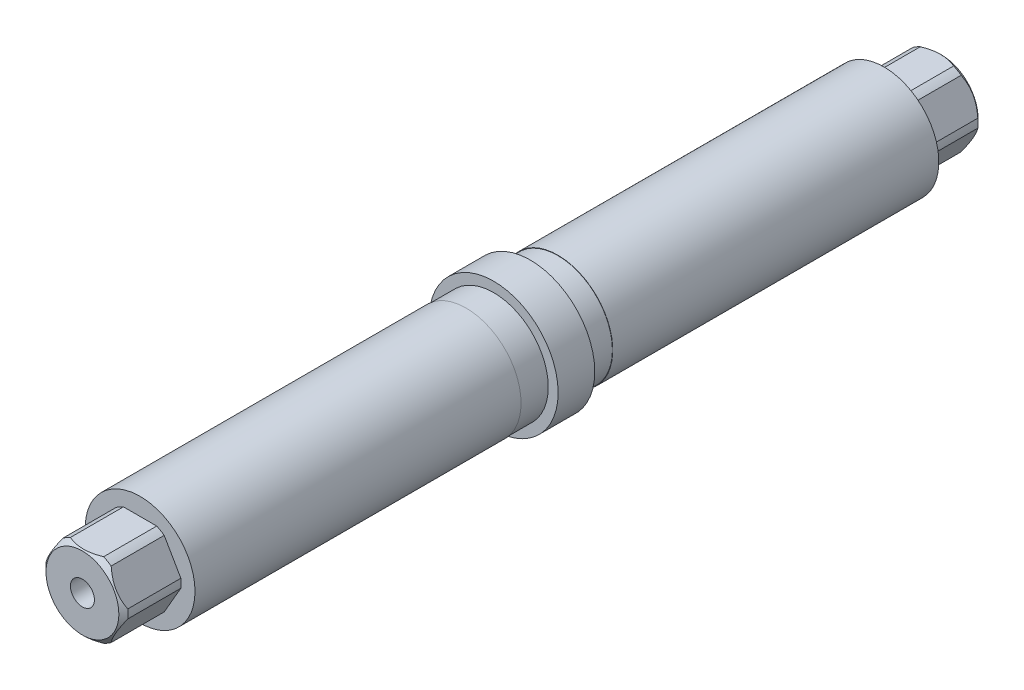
ISO-10303-21;
HEADER;
FILE_DESCRIPTION(('STEP AP214'),'2;1');
FILE_NAME('part.step','',(''),(''),'','','');
FILE_SCHEMA(('AUTOMOTIVE_DESIGN { 1 0 10303 214 1 1 1 1 }'));
ENDSEC;
DATA;
#1=APPLICATION_CONTEXT('core data for automotive mechanical design processes');
#2=APPLICATION_PROTOCOL_DEFINITION('international standard','automotive_design',2000,#1);
#3=PRODUCT_CONTEXT('',#1,'mechanical');
#4=PRODUCT('Part','Part','',(#3));
#5=PRODUCT_RELATED_PRODUCT_CATEGORY('part','',(#4));
#6=PRODUCT_DEFINITION_FORMATION('','',#4);
#7=PRODUCT_DEFINITION_CONTEXT('part definition',#1,'design');
#8=PRODUCT_DEFINITION('design','',#6,#7);
#9=PRODUCT_DEFINITION_SHAPE('','',#8);
#10=(LENGTH_UNIT() NAMED_UNIT(*) SI_UNIT(.MILLI.,.METRE.));
#11=(NAMED_UNIT(*) PLANE_ANGLE_UNIT() SI_UNIT($,.RADIAN.));
#12=(NAMED_UNIT(*) SI_UNIT($,.STERADIAN.) SOLID_ANGLE_UNIT());
#13=UNCERTAINTY_MEASURE_WITH_UNIT(LENGTH_MEASURE(1.E-05),#10,'distance_accuracy_value','');
#14=(GEOMETRIC_REPRESENTATION_CONTEXT(3) GLOBAL_UNCERTAINTY_ASSIGNED_CONTEXT((#13)) GLOBAL_UNIT_ASSIGNED_CONTEXT((#10,
#11,#12)) REPRESENTATION_CONTEXT('',''));
#15=CARTESIAN_POINT('',(0.,0.,0.));
#16=DIRECTION('',(0.,0.,1.));
#17=DIRECTION('',(1.,0.,0.));
#18=AXIS2_PLACEMENT_3D('',#15,#16,#17);
#19=CARTESIAN_POINT('',(7.50555349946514,0.,74.5));
#20=DIRECTION('',(-0.866025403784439,-0.5,0.));
#21=DIRECTION('',(0.5,-0.866025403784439,0.));
#22=AXIS2_PLACEMENT_3D('',#19,#20,#21);
#23=PLANE('',#22);
#24=DIRECTION('',(0.,0.,1.));
#25=VECTOR('',#24,1.);
#26=CARTESIAN_POINT('',(4.18603103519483,5.74958156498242,64.5));
#27=LINE('',#26,#25);
#28=CARTESIAN_POINT('',(4.18603103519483,5.74958156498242,73.70625));
#29=VERTEX_POINT('',#28);
#30=CARTESIAN_POINT('',(4.18603103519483,5.74958156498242,64.5));
#31=VERTEX_POINT('',#30);
#32=EDGE_CURVE('E431',#29,#31,#27,.F.);
#33=ORIENTED_EDGE('',*,*,#32,.F.);
#34=CARTESIAN_POINT('',(4.18591556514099,5.74978156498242,73.7061562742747));
#35=CARTESIAN_POINT('',(4.29385820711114,5.56281942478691,73.7937991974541));
#36=CARTESIAN_POINT('',(4.40335950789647,5.37315760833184,73.8744558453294));
#37=CARTESIAN_POINT('',(4.6254785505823,4.98843614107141,74.0185896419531));
#38=CARTESIAN_POINT('',(4.73810430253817,4.79336261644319,74.0820170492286));
#39=CARTESIAN_POINT('',(4.96480050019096,4.40071328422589,74.1874568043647));
#40=CARTESIAN_POINT('',(5.07884803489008,4.20317715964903,74.2296613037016));
#41=CARTESIAN_POINT('',(5.30839039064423,3.80559813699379,74.2906195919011));
#42=CARTESIAN_POINT('',(5.4238832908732,3.60555856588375,74.3094017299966));
#43=CARTESIAN_POINT('',(5.64993679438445,3.21402241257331,74.3218660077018));
#44=CARTESIAN_POINT('',(5.76048213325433,3.02255226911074,74.3166537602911));
#45=CARTESIAN_POINT('',(5.9807887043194,2.64097009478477,74.284013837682));
#46=CARTESIAN_POINT('',(6.09054953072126,2.450858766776,74.2565754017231));
#47=CARTESIAN_POINT('',(6.30817660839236,2.07391761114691,74.1813636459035));
#48=CARTESIAN_POINT('',(6.41604447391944,1.88708498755,74.1336086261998));
#49=CARTESIAN_POINT('',(6.62943826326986,1.51747610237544,74.0204711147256));
#50=CARTESIAN_POINT('',(6.73496376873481,1.33470056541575,73.9550855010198));
#51=CARTESIAN_POINT('',(6.87845396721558,1.08616825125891,73.8549559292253));
#52=CARTESIAN_POINT('',(6.9175488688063,1.01845389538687,73.8265023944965));
#53=CARTESIAN_POINT('',(6.99529315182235,0.883796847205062,73.7677139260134));
#54=CARTESIAN_POINT('',(7.03394327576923,0.816852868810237,73.7373829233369));
#55=CARTESIAN_POINT('',(7.07241468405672,0.750218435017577,73.7061562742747));
#56=B_SPLINE_CURVE_WITH_KNOTS('',3,(#34,#35,#36,#37,#38,#39,#40,#41,#42,#43,#44,#45,#46,#47,#48,
#49,#50,#51,#52,#53,#54,#55),.UNSPECIFIED.,.F.,.F.,(4,2,2,2,2,2,2,2,2,2,4),(0.,
0.699262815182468,1.40052347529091,2.09531516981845,2.78926510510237,3.45156772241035,
4.11419118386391,4.77621904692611,5.43836421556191,5.68796530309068,5.93706037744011),.UNSPECIFIED.);
#57=CARTESIAN_POINT('',(7.07229921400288,0.750418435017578,73.70625));
#58=VERTEX_POINT('',#57);
#59=EDGE_CURVE('E82',#29,#58,#56,.T.);
#60=ORIENTED_EDGE('',*,*,#59,.T.);
#61=DIRECTION('',(0.,0.,1.));
#62=VECTOR('',#61,1.);
#63=CARTESIAN_POINT('',(7.07229921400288,0.750418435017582,64.5));
#64=LINE('',#63,#62);
#65=CARTESIAN_POINT('',(7.07229921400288,0.750418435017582,64.5));
#66=VERTEX_POINT('',#65);
#67=EDGE_CURVE('E433',#66,#58,#64,.T.);
#68=ORIENTED_EDGE('',*,*,#67,.F.);
#69=DIRECTION('',(-0.5,0.866025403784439,0.));
#70=VECTOR('',#69,1.);
#71=CARTESIAN_POINT('',(7.50555349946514,0.,64.5));
#72=LINE('',#71,#70);
#73=EDGE_CURVE('E436',#66,#31,#72,.T.);
#74=ORIENTED_EDGE('',*,*,#73,.T.);
#75=EDGE_LOOP('',(#33,#60,#68,#74));
#76=FACE_BOUND('',#75,.T.);
#77=ADVANCED_FACE('F60',(#76),#23,.F.);
#78=CARTESIAN_POINT('',(3.75277674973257,6.5,74.5));
#79=DIRECTION('',(0.,-1.,0.));
#80=DIRECTION('',(1.,0.,0.));
#81=AXIS2_PLACEMENT_3D('',#78,#79,#80);
#82=PLANE('',#81);
#83=DIRECTION('',(0.,0.,1.));
#84=VECTOR('',#83,1.);
#85=CARTESIAN_POINT('',(-2.88626817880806,6.5,64.5));
#86=LINE('',#85,#84);
#87=CARTESIAN_POINT('',(-2.88626817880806,6.5,73.70625));
#88=VERTEX_POINT('',#87);
#89=CARTESIAN_POINT('',(-2.88626817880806,6.5,64.5));
#90=VERTEX_POINT('',#89);
#91=EDGE_CURVE('E420',#88,#90,#86,.F.);
#92=ORIENTED_EDGE('',*,*,#91,.F.);
#93=CARTESIAN_POINT('',(-6.40837477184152,6.5,71.6904207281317));
#94=CARTESIAN_POINT('',(-6.24826241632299,6.5,71.802805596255));
#95=CARTESIAN_POINT('',(-6.08715717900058,6.5,71.9138000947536));
#96=CARTESIAN_POINT('',(-5.76262286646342,6.5,72.1324387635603));
#97=CARTESIAN_POINT('',(-5.59919312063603,6.5,72.2400819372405));
#98=CARTESIAN_POINT('',(-5.26854815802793,6.5,72.452162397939));
#99=CARTESIAN_POINT('',(-5.10131388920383,6.5,72.5565701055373));
#100=CARTESIAN_POINT('',(-4.76392231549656,6.5,72.7605277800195));
#101=CARTESIAN_POINT('',(-4.59376524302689,6.5,72.8600781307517));
#102=CARTESIAN_POINT('',(-4.24398834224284,6.5,73.0568206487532));
#103=CARTESIAN_POINT('',(-4.06424789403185,6.5,73.153800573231));
#104=CARTESIAN_POINT('',(-3.70087389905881,6.5,73.3401396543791));
#105=CARTESIAN_POINT('',(-3.51723986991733,6.5,73.4294978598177));
#106=CARTESIAN_POINT('',(-2.96098874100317,6.5,73.683214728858));
#107=CARTESIAN_POINT('',(-2.58175145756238,6.5,73.833956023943));
#108=CARTESIAN_POINT('',(-2.03172492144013,6.5,74.0098501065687));
#109=CARTESIAN_POINT('',(-1.86790264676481,6.5,74.0570727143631));
#110=CARTESIAN_POINT('',(-1.53747537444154,6.5,74.1408038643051));
#111=CARTESIAN_POINT('',(-1.37086999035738,6.5,74.1773109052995));
#112=CARTESIAN_POINT('',(-1.03736904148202,6.5,74.2380086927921));
#113=CARTESIAN_POINT('',(-0.87049834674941,6.5,74.2623348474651));
#114=CARTESIAN_POINT('',(-0.535401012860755,6.5,74.2983648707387));
#115=CARTESIAN_POINT('',(-0.367174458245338,6.5,74.3100695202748));
#116=CARTESIAN_POINT('',(0.0053747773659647,6.5,74.3214447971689));
#117=CARTESIAN_POINT('',(0.20979969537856,6.5,74.3180432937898));
#118=CARTESIAN_POINT('',(0.617444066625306,6.5,74.2921628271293));
#119=CARTESIAN_POINT('',(0.820663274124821,6.5,74.2696801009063));
#120=CARTESIAN_POINT('',(1.22712197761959,6.5,74.2065229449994));
#121=CARTESIAN_POINT('',(1.43032225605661,6.5,74.1655992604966));
#122=CARTESIAN_POINT('',(1.83269613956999,6.5,74.0676440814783));
#123=CARTESIAN_POINT('',(2.03187019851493,6.5,74.0106144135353));
#124=CARTESIAN_POINT('',(2.63089595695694,6.5,73.8163418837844));
#125=CARTESIAN_POINT('',(3.02375760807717,6.5,73.6574088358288));
#126=CARTESIAN_POINT('',(3.59957765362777,6.5,73.3900608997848));
#127=CARTESIAN_POINT('',(3.78960414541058,6.5,73.295923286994));
#128=CARTESIAN_POINT('',(4.16552704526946,6.5,73.0997069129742));
#129=CARTESIAN_POINT('',(4.35142398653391,6.5,72.9976291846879));
#130=CARTESIAN_POINT('',(4.71243045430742,6.5,72.7910500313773));
#131=CARTESIAN_POINT('',(4.88768037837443,6.5,72.6867913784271));
#132=CARTESIAN_POINT('',(5.23514602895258,6.5,72.4733129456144));
#133=CARTESIAN_POINT('',(5.40736151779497,6.5,72.3640927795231));
#134=CARTESIAN_POINT('',(5.74780426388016,6.5,72.1423831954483));
#135=CARTESIAN_POINT('',(5.91605187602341,6.5,72.0299249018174));
#136=CARTESIAN_POINT('',(6.25015792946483,6.5,71.8016134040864));
#137=CARTESIAN_POINT('',(6.41601705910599,6.5,71.6857612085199));
#138=CARTESIAN_POINT('',(6.58086170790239,6.5,71.5685072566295));
#139=B_SPLINE_CURVE_WITH_KNOTS('',3,(#93,#94,#95,#96,#97,#98,#99,#100,#101,#102,#103,#104,#105,
#106,#107,#108,#109,#110,#111,#112,#113,#114,#115,#116,#117,#118,#119,#120,#121,#122,#123,#124,
#125,#126,#127,#128,#129,#130,#131,#132,#133,#134,#135,#136,#137,#138),.UNSPECIFIED.,.F.,.F.,(4,
2,2,2,2,2,2,2,2,2,2,2,2,2,2,2,2,2,2,2,2,2,4),(0.,0.586866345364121,1.17390557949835,
1.76528417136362,2.35661595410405,2.96913188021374,3.5817241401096,4.80250842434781,
5.31370403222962,5.82497121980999,6.33042122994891,6.83583996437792,7.44825472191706,
8.06079027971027,8.68186567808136,9.30287066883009,10.570499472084,11.2066223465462,
11.8426626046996,12.4543296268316,13.0660443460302,13.6731138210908,14.2800046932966),.UNSPECIFIED.);
#140=CARTESIAN_POINT('',(2.88626817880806,6.50000000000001,73.70625));
#141=VERTEX_POINT('',#140);
#142=EDGE_CURVE('E342',#88,#141,#139,.T.);
#143=ORIENTED_EDGE('',*,*,#142,.T.);
#144=DIRECTION('',(0.,0.,1.));
#145=VECTOR('',#144,1.);
#146=CARTESIAN_POINT('',(2.88626817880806,6.5,64.5));
#147=LINE('',#146,#145);
#148=CARTESIAN_POINT('',(2.88626817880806,6.5,64.5));
#149=VERTEX_POINT('',#148);
#150=EDGE_CURVE('E428',#149,#141,#147,.T.);
#151=ORIENTED_EDGE('',*,*,#150,.F.);
#152=DIRECTION('',(-1.,0.,0.));
#153=VECTOR('',#152,1.);
#154=CARTESIAN_POINT('',(3.75277674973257,6.5,64.5));
#155=LINE('',#154,#153);
#156=EDGE_CURVE('E439',#149,#90,#155,.T.);
#157=ORIENTED_EDGE('',*,*,#156,.T.);
#158=EDGE_LOOP('',(#92,#143,#151,#157));
#159=FACE_BOUND('',#158,.T.);
#160=ADVANCED_FACE('F318',(#159),#82,.F.);
#161=CARTESIAN_POINT('',(-3.75277674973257,6.5,74.5));
#162=DIRECTION('',(0.866025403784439,-0.5,0.));
#163=DIRECTION('',(0.5,0.866025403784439,0.));
#164=AXIS2_PLACEMENT_3D('',#161,#162,#163);
#165=PLANE('',#164);
#166=DIRECTION('',(0.,0.,1.));
#167=VECTOR('',#166,1.);
#168=CARTESIAN_POINT('',(-7.07229921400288,0.75041843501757,64.5));
#169=LINE('',#168,#167);
#170=CARTESIAN_POINT('',(-7.07229921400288,0.750418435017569,73.70625));
#171=VERTEX_POINT('',#170);
#172=CARTESIAN_POINT('',(-7.07229921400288,0.75041843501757,64.5));
#173=VERTEX_POINT('',#172);
#174=EDGE_CURVE('E409',#171,#173,#169,.F.);
#175=ORIENTED_EDGE('',*,*,#174,.F.);
#176=CARTESIAN_POINT('',(-7.07241468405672,0.750218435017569,73.7061562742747));
#177=CARTESIAN_POINT('',(-6.96447204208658,0.937180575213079,73.7937991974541));
#178=CARTESIAN_POINT('',(-6.85497074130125,1.12684239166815,73.8744558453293));
#179=CARTESIAN_POINT('',(-6.63285169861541,1.51156385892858,74.0185896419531));
#180=CARTESIAN_POINT('',(-6.52022594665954,1.7066373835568,74.0820170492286));
#181=CARTESIAN_POINT('',(-6.29352974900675,2.0992867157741,74.1874568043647));
#182=CARTESIAN_POINT('',(-6.17948221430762,2.29682284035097,74.2296613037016));
#183=CARTESIAN_POINT('',(-5.94993985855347,2.69440186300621,74.2906195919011));
#184=CARTESIAN_POINT('',(-5.83444695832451,2.89444143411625,74.3094017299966));
#185=CARTESIAN_POINT('',(-5.60839345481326,3.28597758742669,74.3218660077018));
#186=CARTESIAN_POINT('',(-5.49784811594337,3.47744773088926,74.3166537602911));
#187=CARTESIAN_POINT('',(-5.2775415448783,3.85902990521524,74.284013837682));
#188=CARTESIAN_POINT('',(-5.16778071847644,4.04914123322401,74.2565754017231));
#189=CARTESIAN_POINT('',(-4.95015364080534,4.4260823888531,74.1813636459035));
#190=CARTESIAN_POINT('',(-4.84228577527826,4.61291501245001,74.1336086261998));
#191=CARTESIAN_POINT('',(-4.62889198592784,4.98252389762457,74.0204711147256));
#192=CARTESIAN_POINT('',(-4.52336648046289,5.16529943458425,73.9550855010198));
#193=CARTESIAN_POINT('',(-4.37987628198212,5.41383174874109,73.8549559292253));
#194=CARTESIAN_POINT('',(-4.3407813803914,5.48154610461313,73.8265023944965));
#195=CARTESIAN_POINT('',(-4.26303709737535,5.61620315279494,73.7677139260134));
#196=CARTESIAN_POINT('',(-4.22438697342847,5.68314713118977,73.7373829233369));
#197=CARTESIAN_POINT('',(-4.18591556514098,5.74978156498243,73.7061562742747));
#198=B_SPLINE_CURVE_WITH_KNOTS('',3,(#176,#177,#178,#179,#180,#181,#182,#183,#184,#185,#186,
#187,#188,#189,#190,#191,#192,#193,#194,#195,#196,#197),.UNSPECIFIED.,.F.,.F.,(4,2,2,2,2,2,2,2,
2,2,4),(0.,0.699262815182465,1.40052347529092,2.09531516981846,2.78926510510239,
3.45156772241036,4.11419118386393,4.77621904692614,5.43836421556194,5.6879653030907,
5.93706037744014),.UNSPECIFIED.);
#199=CARTESIAN_POINT('',(-4.18603103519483,5.74958156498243,73.70625));
#200=VERTEX_POINT('',#199);
#201=EDGE_CURVE('E371',#171,#200,#198,.T.);
#202=ORIENTED_EDGE('',*,*,#201,.T.);
#203=DIRECTION('',(0.,0.,1.));
#204=VECTOR('',#203,1.);
#205=CARTESIAN_POINT('',(-4.18603103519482,5.74958156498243,64.5));
#206=LINE('',#205,#204);
#207=CARTESIAN_POINT('',(-4.18603103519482,5.74958156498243,64.5));
#208=VERTEX_POINT('',#207);
#209=EDGE_CURVE('E417',#208,#200,#206,.T.);
#210=ORIENTED_EDGE('',*,*,#209,.F.);
#211=DIRECTION('',(-0.5,-0.866025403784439,0.));
#212=VECTOR('',#211,1.);
#213=CARTESIAN_POINT('',(-3.75277674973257,6.5,64.5));
#214=LINE('',#213,#212);
#215=EDGE_CURVE('E413',#208,#173,#214,.T.);
#216=ORIENTED_EDGE('',*,*,#215,.T.);
#217=EDGE_LOOP('',(#175,#202,#210,#216));
#218=FACE_BOUND('',#217,.T.);
#219=ADVANCED_FACE('F324',(#218),#165,.F.);
#220=CARTESIAN_POINT('',(-7.50555349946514,0.,74.5));
#221=DIRECTION('',(0.866025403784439,0.5,0.));
#222=DIRECTION('',(-0.5,0.866025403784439,0.));
#223=AXIS2_PLACEMENT_3D('',#220,#221,#222);
#224=PLANE('',#223);
#225=DIRECTION('',(0.,0.,1.));
#226=VECTOR('',#225,1.);
#227=CARTESIAN_POINT('',(-4.18603103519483,-5.74958156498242,64.5));
#228=LINE('',#227,#226);
#229=CARTESIAN_POINT('',(-4.18603103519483,-5.74958156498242,73.70625));
#230=VERTEX_POINT('',#229);
#231=CARTESIAN_POINT('',(-4.18603103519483,-5.74958156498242,64.5));
#232=VERTEX_POINT('',#231);
#233=EDGE_CURVE('E423',#230,#232,#228,.F.);
#234=ORIENTED_EDGE('',*,*,#233,.F.);
#235=CARTESIAN_POINT('',(-4.18591556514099,-5.74978156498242,73.7061562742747));
#236=CARTESIAN_POINT('',(-4.29385820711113,-5.56281942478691,73.7937991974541));
#237=CARTESIAN_POINT('',(-4.40335950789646,-5.37315760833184,73.8744558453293));
#238=CARTESIAN_POINT('',(-4.6254785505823,-4.98843614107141,74.0185896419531));
#239=CARTESIAN_POINT('',(-4.73810430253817,-4.79336261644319,74.0820170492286));
#240=CARTESIAN_POINT('',(-4.96480050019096,-4.40071328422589,74.1874568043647));
#241=CARTESIAN_POINT('',(-5.07884803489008,-4.20317715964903,74.2296613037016));
#242=CARTESIAN_POINT('',(-5.30839039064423,-3.8055981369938,74.2906195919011));
#243=CARTESIAN_POINT('',(-5.42388329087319,-3.60555856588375,74.3094017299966));
#244=CARTESIAN_POINT('',(-5.64993679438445,-3.21402241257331,74.3218660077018));
#245=CARTESIAN_POINT('',(-5.76048213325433,-3.02255226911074,74.3166537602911));
#246=CARTESIAN_POINT('',(-5.9807887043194,-2.64097009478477,74.284013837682));
#247=CARTESIAN_POINT('',(-6.09054953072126,-2.45085876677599,74.2565754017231));
#248=CARTESIAN_POINT('',(-6.30817660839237,-2.0739176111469,74.1813636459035));
#249=CARTESIAN_POINT('',(-6.41604447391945,-1.88708498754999,74.1336086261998));
#250=CARTESIAN_POINT('',(-6.62943826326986,-1.51747610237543,74.0204711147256));
#251=CARTESIAN_POINT('',(-6.73496376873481,-1.33470056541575,73.9550855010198));
#252=CARTESIAN_POINT('',(-6.87845396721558,-1.08616825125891,73.8549559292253));
#253=CARTESIAN_POINT('',(-6.91754886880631,-1.01845389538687,73.8265023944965));
#254=CARTESIAN_POINT('',(-6.99529315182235,-0.88379684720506,73.7677139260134));
#255=CARTESIAN_POINT('',(-7.03394327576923,-0.816852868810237,73.7373829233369));
#256=CARTESIAN_POINT('',(-7.07241468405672,-0.750218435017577,73.7061562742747));
#257=B_SPLINE_CURVE_WITH_KNOTS('',3,(#235,#236,#237,#238,#239,#240,#241,#242,#243,#244,#245,
#246,#247,#248,#249,#250,#251,#252,#253,#254,#255,#256),.UNSPECIFIED.,.F.,.F.,(4,2,2,2,2,2,2,2,
2,2,4),(0.,0.699262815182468,1.40052347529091,2.09531516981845,2.78926510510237,
3.45156772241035,4.11419118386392,4.77621904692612,5.43836421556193,5.68796530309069,
5.93706037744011),.UNSPECIFIED.);
#258=CARTESIAN_POINT('',(-7.07229921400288,-0.75041843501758,73.70625));
#259=VERTEX_POINT('',#258);
#260=EDGE_CURVE('E384',#230,#259,#257,.T.);
#261=ORIENTED_EDGE('',*,*,#260,.T.);
#262=DIRECTION('',(0.,0.,1.));
#263=VECTOR('',#262,1.);
#264=CARTESIAN_POINT('',(-7.07229921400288,-0.75041843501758,64.5));
#265=LINE('',#264,#263);
#266=CARTESIAN_POINT('',(-7.07229921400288,-0.75041843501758,64.5));
#267=VERTEX_POINT('',#266);
#268=EDGE_CURVE('E418',#267,#259,#265,.T.);
#269=ORIENTED_EDGE('',*,*,#268,.F.);
#270=DIRECTION('',(0.5,-0.866025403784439,0.));
#271=VECTOR('',#270,1.);
#272=CARTESIAN_POINT('',(-7.50555349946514,0.,64.5));
#273=LINE('',#272,#271);
#274=EDGE_CURVE('E443',#267,#232,#273,.T.);
#275=ORIENTED_EDGE('',*,*,#274,.T.);
#276=EDGE_LOOP('',(#234,#261,#269,#275));
#277=FACE_BOUND('',#276,.T.);
#278=ADVANCED_FACE('F395',(#277),#224,.F.);
#279=CARTESIAN_POINT('',(-3.75277674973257,-6.5,74.5));
#280=DIRECTION('',(0.,1.,0.));
#281=DIRECTION('',(-1.,0.,0.));
#282=AXIS2_PLACEMENT_3D('',#279,#280,#281);
#283=PLANE('',#282);
#284=DIRECTION('',(0.,0.,1.));
#285=VECTOR('',#284,1.);
#286=CARTESIAN_POINT('',(2.88626817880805,-6.5,64.5));
#287=LINE('',#286,#285);
#288=CARTESIAN_POINT('',(2.88626817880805,-6.5,73.70625));
#289=VERTEX_POINT('',#288);
#290=CARTESIAN_POINT('',(2.88626817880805,-6.5,64.5));
#291=VERTEX_POINT('',#290);
#292=EDGE_CURVE('E530',#289,#291,#287,.F.);
#293=ORIENTED_EDGE('',*,*,#292,.F.);
#294=CARTESIAN_POINT('',(-6.40837477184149,-6.5,71.6904207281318));
#295=CARTESIAN_POINT('',(-6.24826241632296,-6.5,71.802805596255));
#296=CARTESIAN_POINT('',(-6.08715717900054,-6.5,71.9138000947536));
#297=CARTESIAN_POINT('',(-5.76262286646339,-6.5,72.1324387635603));
#298=CARTESIAN_POINT('',(-5.59919312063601,-6.5,72.2400819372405));
#299=CARTESIAN_POINT('',(-5.26854815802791,-6.5,72.452162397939));
#300=CARTESIAN_POINT('',(-5.10131388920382,-6.5,72.5565701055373));
#301=CARTESIAN_POINT('',(-4.76392231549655,-6.5,72.7605277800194));
#302=CARTESIAN_POINT('',(-4.59376524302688,-6.5,72.8600781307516));
#303=CARTESIAN_POINT('',(-4.24398834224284,-6.5,73.0568206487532));
#304=CARTESIAN_POINT('',(-4.06424789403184,-6.5,73.153800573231));
#305=CARTESIAN_POINT('',(-3.70087389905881,-6.5,73.3401396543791));
#306=CARTESIAN_POINT('',(-3.51723986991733,-6.5,73.4294978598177));
#307=CARTESIAN_POINT('',(-2.96098874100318,-6.5,73.683214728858));
#308=CARTESIAN_POINT('',(-2.58175145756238,-6.5,73.833956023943));
#309=CARTESIAN_POINT('',(-2.03172492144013,-6.5,74.0098501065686));
#310=CARTESIAN_POINT('',(-1.86790264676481,-6.5,74.057072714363));
#311=CARTESIAN_POINT('',(-1.53747537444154,-6.5,74.140803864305));
#312=CARTESIAN_POINT('',(-1.37086999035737,-6.5,74.1773109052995));
#313=CARTESIAN_POINT('',(-1.03736904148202,-6.5,74.2380086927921));
#314=CARTESIAN_POINT('',(-0.870498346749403,-6.5,74.2623348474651));
#315=CARTESIAN_POINT('',(-0.535401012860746,-6.5,74.2983648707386));
#316=CARTESIAN_POINT('',(-0.367174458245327,-6.5,74.3100695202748));
#317=CARTESIAN_POINT('',(0.00537477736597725,-6.5,74.3214447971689));
#318=CARTESIAN_POINT('',(0.209799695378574,-6.5,74.3180432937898));
#319=CARTESIAN_POINT('',(0.617444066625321,-6.5,74.2921628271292));
#320=CARTESIAN_POINT('',(0.820663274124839,-6.5,74.2696801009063));
#321=CARTESIAN_POINT('',(1.22712197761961,-6.5,74.2065229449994));
#322=CARTESIAN_POINT('',(1.43032225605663,-6.5,74.1655992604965));
#323=CARTESIAN_POINT('',(1.83269613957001,-6.5,74.0676440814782));
#324=CARTESIAN_POINT('',(2.03187019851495,-6.5,74.0106144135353));
#325=CARTESIAN_POINT('',(2.63089595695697,-6.50000000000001,73.8163418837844));
#326=CARTESIAN_POINT('',(3.0237576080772,-6.5,73.6574088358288));
#327=CARTESIAN_POINT('',(3.59957765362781,-6.5,73.3900608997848));
#328=CARTESIAN_POINT('',(3.78960414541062,-6.5,73.2959232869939));
#329=CARTESIAN_POINT('',(4.16552704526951,-6.5,73.0997069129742));
#330=CARTESIAN_POINT('',(4.35142398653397,-6.5,72.9976291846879));
#331=CARTESIAN_POINT('',(4.71243045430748,-6.5,72.7910500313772));
#332=CARTESIAN_POINT('',(4.88768037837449,-6.5,72.686791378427));
#333=CARTESIAN_POINT('',(5.23514602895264,-6.5,72.4733129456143));
#334=CARTESIAN_POINT('',(5.40736151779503,-6.5,72.364092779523));
#335=CARTESIAN_POINT('',(5.74780426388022,-6.5,72.1423831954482));
#336=CARTESIAN_POINT('',(5.91605187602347,-6.50000000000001,72.0299249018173));
#337=CARTESIAN_POINT('',(6.2501579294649,-6.50000000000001,71.8016134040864));
#338=CARTESIAN_POINT('',(6.41601705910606,-6.50000000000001,71.6857612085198));
#339=CARTESIAN_POINT('',(6.58086170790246,-6.50000000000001,71.5685072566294));
#340=B_SPLINE_CURVE_WITH_KNOTS('',3,(#294,#295,#296,#297,#298,#299,#300,#301,#302,#303,#304,
#305,#306,#307,#308,#309,#310,#311,#312,#313,#314,#315,#316,#317,#318,#319,#320,#321,#322,#323,
#324,#325,#326,#327,#328,#329,#330,#331,#332,#333,#334,#335,#336,#337,#338,#339),.UNSPECIFIED.,
.F.,.F.,(4,2,2,2,2,2,2,2,2,2,2,2,2,2,2,2,2,2,2,2,2,2,4),(0.,0.586866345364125,1.17390557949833,
1.76528417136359,2.35661595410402,2.9691318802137,3.58172414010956,4.80250842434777,
5.31370403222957,5.82497121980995,6.33042122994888,6.83583996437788,7.44825472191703,
8.06079027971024,8.68186567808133,9.30287066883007,10.570499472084,11.2066223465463,
11.8426626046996,12.4543296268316,13.0660443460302,13.6731138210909,14.2800046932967),.UNSPECIFIED.);
#341=CARTESIAN_POINT('',(-2.88626817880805,-6.5,73.70625));
#342=VERTEX_POINT('',#341);
#343=EDGE_CURVE('E377',#289,#342,#340,.F.);
#344=ORIENTED_EDGE('',*,*,#343,.T.);
#345=DIRECTION('',(0.,0.,1.));
#346=VECTOR('',#345,1.);
#347=CARTESIAN_POINT('',(-2.88626817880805,-6.5,64.5));
#348=LINE('',#347,#346);
#349=CARTESIAN_POINT('',(-2.88626817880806,-6.5,64.5));
#350=VERTEX_POINT('',#349);
#351=EDGE_CURVE('E527',#350,#342,#348,.T.);
#352=ORIENTED_EDGE('',*,*,#351,.F.);
#353=DIRECTION('',(1.,0.,0.));
#354=VECTOR('',#353,1.);
#355=CARTESIAN_POINT('',(-3.75277674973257,-6.5,64.5));
#356=LINE('',#355,#354);
#357=EDGE_CURVE('E446',#350,#291,#356,.T.);
#358=ORIENTED_EDGE('',*,*,#357,.T.);
#359=EDGE_LOOP('',(#293,#344,#352,#358));
#360=FACE_BOUND('',#359,.T.);
#361=ADVANCED_FACE('F391',(#360),#283,.F.);
#362=CARTESIAN_POINT('',(3.75277674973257,-6.5,74.5));
#363=DIRECTION('',(-0.866025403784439,0.5,0.));
#364=DIRECTION('',(-0.5,-0.866025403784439,0.));
#365=AXIS2_PLACEMENT_3D('',#362,#363,#364);
#366=PLANE('',#365);
#367=DIRECTION('',(0.,0.,1.));
#368=VECTOR('',#367,1.);
#369=CARTESIAN_POINT('',(7.07229921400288,-0.750418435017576,64.5));
#370=LINE('',#369,#368);
#371=CARTESIAN_POINT('',(7.07229921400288,-0.750418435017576,73.70625));
#372=VERTEX_POINT('',#371);
#373=CARTESIAN_POINT('',(7.07229921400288,-0.750418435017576,64.5));
#374=VERTEX_POINT('',#373);
#375=EDGE_CURVE('E502',#372,#374,#370,.F.);
#376=ORIENTED_EDGE('',*,*,#375,.F.);
#377=CARTESIAN_POINT('',(7.07241468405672,-0.750218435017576,73.7061562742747));
#378=CARTESIAN_POINT('',(6.96447204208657,-0.937180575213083,73.7937991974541));
#379=CARTESIAN_POINT('',(6.85497074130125,-1.12684239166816,73.8744558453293));
#380=CARTESIAN_POINT('',(6.63285169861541,-1.51156385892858,74.0185896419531));
#381=CARTESIAN_POINT('',(6.52022594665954,-1.70663738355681,74.0820170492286));
#382=CARTESIAN_POINT('',(6.29352974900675,-2.09928671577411,74.1874568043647));
#383=CARTESIAN_POINT('',(6.17948221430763,-2.29682284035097,74.2296613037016));
#384=CARTESIAN_POINT('',(5.94993985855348,-2.6944018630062,74.2906195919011));
#385=CARTESIAN_POINT('',(5.83444695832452,-2.89444143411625,74.3094017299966));
#386=CARTESIAN_POINT('',(5.60839345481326,-3.28597758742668,74.3218660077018));
#387=CARTESIAN_POINT('',(5.49784811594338,-3.47744773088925,74.3166537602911));
#388=CARTESIAN_POINT('',(5.27754154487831,-3.85902990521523,74.284013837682));
#389=CARTESIAN_POINT('',(5.16778071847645,-4.049141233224,74.2565754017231));
#390=CARTESIAN_POINT('',(4.95015364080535,-4.42608238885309,74.1813636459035));
#391=CARTESIAN_POINT('',(4.84228577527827,-4.61291501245,74.1336086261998));
#392=CARTESIAN_POINT('',(4.62889198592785,-4.98252389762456,74.0204711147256));
#393=CARTESIAN_POINT('',(4.5233664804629,-5.16529943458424,73.9550855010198));
#394=CARTESIAN_POINT('',(4.37987628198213,-5.41383174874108,73.8549559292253));
#395=CARTESIAN_POINT('',(4.3407813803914,-5.48154610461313,73.8265023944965));
#396=CARTESIAN_POINT('',(4.26303709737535,-5.61620315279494,73.7677139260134));
#397=CARTESIAN_POINT('',(4.22438697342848,-5.68314713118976,73.7373829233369));
#398=CARTESIAN_POINT('',(4.18591556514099,-5.74978156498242,73.7061562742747));
#399=B_SPLINE_CURVE_WITH_KNOTS('',3,(#377,#378,#379,#380,#381,#382,#383,#384,#385,#386,#387,
#388,#389,#390,#391,#392,#393,#394,#395,#396,#397,#398),.UNSPECIFIED.,.F.,.F.,(4,2,2,2,2,2,2,2,
2,2,4),(0.,0.699262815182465,1.40052347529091,2.09531516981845,2.78926510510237,
3.45156772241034,4.11419118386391,4.77621904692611,5.43836421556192,5.68796530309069,
5.93706037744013),.UNSPECIFIED.);
#400=CARTESIAN_POINT('',(4.18603103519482,-5.74958156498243,73.70625));
#401=VERTEX_POINT('',#400);
#402=EDGE_CURVE('E365',#372,#401,#399,.T.);
#403=ORIENTED_EDGE('',*,*,#402,.T.);
#404=DIRECTION('',(0.,0.,1.));
#405=VECTOR('',#404,1.);
#406=CARTESIAN_POINT('',(4.18603103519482,-5.74958156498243,64.5));
#407=LINE('',#406,#405);
#408=CARTESIAN_POINT('',(4.18603103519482,-5.74958156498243,64.5));
#409=VERTEX_POINT('',#408);
#410=EDGE_CURVE('E506',#409,#401,#407,.T.);
#411=ORIENTED_EDGE('',*,*,#410,.F.);
#412=DIRECTION('',(0.5,0.866025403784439,0.));
#413=VECTOR('',#412,1.);
#414=CARTESIAN_POINT('',(3.75277674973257,-6.5,64.5));
#415=LINE('',#414,#413);
#416=EDGE_CURVE('E449',#409,#374,#415,.T.);
#417=ORIENTED_EDGE('',*,*,#416,.T.);
#418=EDGE_LOOP('',(#376,#403,#411,#417));
#419=FACE_BOUND('',#418,.T.);
#420=ADVANCED_FACE('F394',(#419),#366,.F.);
#421=CARTESIAN_POINT('',(0.,0.,64.5));
#422=DIRECTION('',(0.,0.,1.));
#423=DIRECTION('',(1.,0.,0.));
#424=AXIS2_PLACEMENT_3D('',#421,#422,#423);
#425=PLANE('',#424);
#426=CARTESIAN_POINT('',(0.,0.,64.5));
#427=DIRECTION('',(0.,0.,1.));
#428=DIRECTION('',(1.,0.,0.));
#429=AXIS2_PLACEMENT_3D('',#426,#427,#428);
#430=CIRCLE('',#429,7.112);
#431=EDGE_CURVE('E499',#31,#149,#430,.T.);
#432=ORIENTED_EDGE('',*,*,#431,.F.);
#433=ORIENTED_EDGE('',*,*,#73,.F.);
#434=EDGE_CURVE('E505',#374,#66,#430,.T.);
#435=ORIENTED_EDGE('',*,*,#434,.F.);
#436=ORIENTED_EDGE('',*,*,#416,.F.);
#437=EDGE_CURVE('E509',#291,#409,#430,.T.);
#438=ORIENTED_EDGE('',*,*,#437,.F.);
#439=ORIENTED_EDGE('',*,*,#357,.F.);
#440=EDGE_CURVE('E514',#232,#350,#430,.T.);
#441=ORIENTED_EDGE('',*,*,#440,.F.);
#442=ORIENTED_EDGE('',*,*,#274,.F.);
#443=EDGE_CURVE('E508',#173,#267,#430,.T.);
#444=ORIENTED_EDGE('',*,*,#443,.F.);
#445=ORIENTED_EDGE('',*,*,#215,.F.);
#446=EDGE_CURVE('E503',#90,#208,#430,.T.);
#447=ORIENTED_EDGE('',*,*,#446,.F.);
#448=ORIENTED_EDGE('',*,*,#156,.F.);
#449=EDGE_LOOP('',(#432,#433,#435,#436,#438,#439,#441,#442,#444,#445,#447,#448));
#450=FACE_BOUND('',#449,.T.);
#451=CARTESIAN_POINT('',(0.,0.,64.5));
#452=DIRECTION('',(0.,0.,1.));
#453=DIRECTION('',(1.,0.,0.));
#454=AXIS2_PLACEMENT_3D('',#451,#452,#453);
#455=CIRCLE('',#454,9.525);
#456=CARTESIAN_POINT('',(9.525,0.,64.5));
#457=VERTEX_POINT('',#456);
#458=EDGE_CURVE('E461',#457,#457,#455,.T.);
#459=ORIENTED_EDGE('',*,*,#458,.T.);
#460=EDGE_LOOP('',(#459));
#461=FACE_BOUND('',#460,.T.);
#462=ADVANCED_FACE('F533',(#450,#461),#425,.T.);
#463=CARTESIAN_POINT('',(0.,0.,-3.175));
#464=DIRECTION('',(0.,0.,1.));
#465=DIRECTION('',(1.,0.,0.));
#466=AXIS2_PLACEMENT_3D('',#463,#464,#465);
#467=PLANE('',#466);
#468=CARTESIAN_POINT('',(0.,0.,-3.175));
#469=DIRECTION('',(0.,0.,1.));
#470=DIRECTION('',(1.,0.,0.));
#471=AXIS2_PLACEMENT_3D('',#468,#469,#470);
#472=CIRCLE('',#471,11.176);
#473=CARTESIAN_POINT('',(11.176,0.,-3.175));
#474=VERTEX_POINT('',#473);
#475=EDGE_CURVE('E476',#474,#474,#472,.T.);
#476=ORIENTED_EDGE('',*,*,#475,.F.);
#477=EDGE_LOOP('',(#476));
#478=FACE_BOUND('',#477,.T.);
#479=CARTESIAN_POINT('',(0.,0.,-3.175));
#480=DIRECTION('',(0.,0.,1.));
#481=DIRECTION('',(1.,0.,0.));
#482=AXIS2_PLACEMENT_3D('',#479,#480,#481);
#483=CIRCLE('',#482,9.4615);
#484=CARTESIAN_POINT('',(9.4615,0.,-3.175));
#485=VERTEX_POINT('',#484);
#486=EDGE_CURVE('E484',#485,#485,#483,.F.);
#487=ORIENTED_EDGE('',*,*,#486,.F.);
#488=EDGE_LOOP('',(#487));
#489=FACE_BOUND('',#488,.T.);
#490=ADVANCED_FACE('F599',(#478,#489),#467,.F.);
#491=CARTESIAN_POINT('',(0.,0.,3.175));
#492=DIRECTION('',(0.,0.,1.));
#493=DIRECTION('',(1.,0.,0.));
#494=AXIS2_PLACEMENT_3D('',#491,#492,#493);
#495=PLANE('',#494);
#496=CARTESIAN_POINT('',(0.,0.,3.175));
#497=DIRECTION('',(0.,0.,1.));
#498=DIRECTION('',(1.,0.,0.));
#499=AXIS2_PLACEMENT_3D('',#496,#497,#498);
#500=CIRCLE('',#499,11.176);
#501=CARTESIAN_POINT('',(11.176,0.,3.175));
#502=VERTEX_POINT('',#501);
#503=EDGE_CURVE('E480',#502,#502,#500,.T.);
#504=ORIENTED_EDGE('',*,*,#503,.T.);
#505=EDGE_LOOP('',(#504));
#506=FACE_BOUND('',#505,.T.);
#507=CARTESIAN_POINT('',(0.,0.,3.175));
#508=DIRECTION('',(0.,0.,1.));
#509=DIRECTION('',(1.,0.,0.));
#510=AXIS2_PLACEMENT_3D('',#507,#508,#509);
#511=CIRCLE('',#510,9.4615);
#512=CARTESIAN_POINT('',(9.4615,0.,3.175));
#513=VERTEX_POINT('',#512);
#514=EDGE_CURVE('E471',#513,#513,#511,.T.);
#515=ORIENTED_EDGE('',*,*,#514,.F.);
#516=EDGE_LOOP('',(#515));
#517=FACE_BOUND('',#516,.T.);
#518=ADVANCED_FACE('F601',(#506,#517),#495,.T.);
#519=CARTESIAN_POINT('',(0.,0.,3.175));
#520=DIRECTION('',(0.,0.,-1.));
#521=DIRECTION('',(-1.,0.,0.));
#522=AXIS2_PLACEMENT_3D('',#519,#520,#521);
#523=CYLINDRICAL_SURFACE('',#522,11.176);
#524=ORIENTED_EDGE('',*,*,#503,.F.);
#525=EDGE_LOOP('',(#524));
#526=FACE_BOUND('',#525,.T.);
#527=ORIENTED_EDGE('',*,*,#475,.T.);
#528=EDGE_LOOP('',(#527));
#529=FACE_BOUND('',#528,.T.);
#530=ADVANCED_FACE('F62',(#526,#529),#523,.T.);
#531=CARTESIAN_POINT('',(0.,0.,7.9502));
#532=DIRECTION('',(0.,0.,-1.));
#533=DIRECTION('',(-1.,0.,0.));
#534=AXIS2_PLACEMENT_3D('',#531,#532,#533);
#535=CYLINDRICAL_SURFACE('',#534,9.4615);
#536=CARTESIAN_POINT('',(0.,0.,7.9502));
#537=DIRECTION('',(0.,0.,1.));
#538=DIRECTION('',(1.,0.,0.));
#539=AXIS2_PLACEMENT_3D('',#536,#537,#538);
#540=CIRCLE('',#539,9.4615);
#541=CARTESIAN_POINT('',(9.4615,0.,7.9502));
#542=VERTEX_POINT('',#541);
#543=EDGE_CURVE('E472',#542,#542,#540,.T.);
#544=ORIENTED_EDGE('',*,*,#543,.F.);
#545=EDGE_LOOP('',(#544));
#546=FACE_BOUND('',#545,.T.);
#547=ORIENTED_EDGE('',*,*,#514,.T.);
#548=EDGE_LOOP('',(#547));
#549=FACE_BOUND('',#548,.T.);
#550=ADVANCED_FACE('F595',(#546,#549),#535,.T.);
#551=CARTESIAN_POINT('',(0.,0.,-7.9502));
#552=DIRECTION('',(0.,0.,1.));
#553=DIRECTION('',(1.,0.,0.));
#554=AXIS2_PLACEMENT_3D('',#551,#552,#553);
#555=CYLINDRICAL_SURFACE('',#554,9.4615);
#556=CARTESIAN_POINT('',(0.,0.,-7.9502));
#557=DIRECTION('',(0.,0.,-1.));
#558=DIRECTION('',(-1.,0.,0.));
#559=AXIS2_PLACEMENT_3D('',#556,#557,#558);
#560=CIRCLE('',#559,9.4615);
#561=CARTESIAN_POINT('',(-9.4615,0.,-7.9502));
#562=VERTEX_POINT('',#561);
#563=EDGE_CURVE('E464',#562,#562,#560,.T.);
#564=ORIENTED_EDGE('',*,*,#563,.F.);
#565=EDGE_LOOP('',(#564));
#566=FACE_BOUND('',#565,.T.);
#567=ORIENTED_EDGE('',*,*,#486,.T.);
#568=EDGE_LOOP('',(#567));
#569=FACE_BOUND('',#568,.T.);
#570=ADVANCED_FACE('F591',(#566,#569),#555,.T.);
#571=CARTESIAN_POINT('',(0.,0.,7.9502));
#572=DIRECTION('',(0.,0.,1.));
#573=DIRECTION('',(1.,0.,0.));
#574=AXIS2_PLACEMENT_3D('',#571,#572,#573);
#575=PLANE('',#574);
#576=CARTESIAN_POINT('',(0.,0.,7.9502));
#577=DIRECTION('',(0.,0.,1.));
#578=DIRECTION('',(1.,0.,0.));
#579=AXIS2_PLACEMENT_3D('',#576,#577,#578);
#580=CIRCLE('',#579,9.525);
#581=CARTESIAN_POINT('',(9.525,0.,7.9502));
#582=VERTEX_POINT('',#581);
#583=EDGE_CURVE('E457',#582,#582,#580,.T.);
#584=ORIENTED_EDGE('',*,*,#583,.F.);
#585=EDGE_LOOP('',(#584));
#586=FACE_BOUND('',#585,.T.);
#587=ORIENTED_EDGE('',*,*,#543,.T.);
#588=EDGE_LOOP('',(#587));
#589=FACE_BOUND('',#588,.T.);
#590=ADVANCED_FACE('F594',(#586,#589),#575,.F.);
#591=CARTESIAN_POINT('',(0.,0.,64.5));
#592=DIRECTION('',(0.,0.,-1.));
#593=DIRECTION('',(-1.,0.,0.));
#594=AXIS2_PLACEMENT_3D('',#591,#592,#593);
#595=CYLINDRICAL_SURFACE('',#594,9.525);
#596=ORIENTED_EDGE('',*,*,#458,.F.);
#597=EDGE_LOOP('',(#596));
#598=FACE_BOUND('',#597,.T.);
#599=ORIENTED_EDGE('',*,*,#583,.T.);
#600=EDGE_LOOP('',(#599));
#601=FACE_BOUND('',#600,.T.);
#602=ADVANCED_FACE('F588',(#598,#601),#595,.T.);
#603=CARTESIAN_POINT('',(0.,0.,-7.9502));
#604=DIRECTION('',(0.,0.,-1.));
#605=DIRECTION('',(-1.,0.,0.));
#606=AXIS2_PLACEMENT_3D('',#603,#604,#605);
#607=PLANE('',#606);
#608=CARTESIAN_POINT('',(0.,0.,-7.9502));
#609=DIRECTION('',(0.,0.,-1.));
#610=DIRECTION('',(-1.,0.,0.));
#611=AXIS2_PLACEMENT_3D('',#608,#609,#610);
#612=CIRCLE('',#611,9.525);
#613=CARTESIAN_POINT('',(-9.525,0.,-7.9502));
#614=VERTEX_POINT('',#613);
#615=EDGE_CURVE('E452',#614,#614,#612,.T.);
#616=ORIENTED_EDGE('',*,*,#615,.F.);
#617=EDGE_LOOP('',(#616));
#618=FACE_BOUND('',#617,.T.);
#619=ORIENTED_EDGE('',*,*,#563,.T.);
#620=EDGE_LOOP('',(#619));
#621=FACE_BOUND('',#620,.T.);
#622=ADVANCED_FACE('F573',(#618,#621),#607,.F.);
#623=CARTESIAN_POINT('',(0.,0.,-64.5));
#624=DIRECTION('',(0.,0.,1.));
#625=DIRECTION('',(1.,0.,0.));
#626=AXIS2_PLACEMENT_3D('',#623,#624,#625);
#627=CYLINDRICAL_SURFACE('',#626,9.525);
#628=CARTESIAN_POINT('',(0.,0.,-64.5));
#629=DIRECTION('',(0.,0.,-1.));
#630=DIRECTION('',(-1.,0.,0.));
#631=AXIS2_PLACEMENT_3D('',#628,#629,#630);
#632=CIRCLE('',#631,9.525);
#633=CARTESIAN_POINT('',(-9.525,0.,-64.5));
#634=VERTEX_POINT('',#633);
#635=EDGE_CURVE('E453',#634,#634,#632,.T.);
#636=ORIENTED_EDGE('',*,*,#635,.F.);
#637=EDGE_LOOP('',(#636));
#638=FACE_BOUND('',#637,.T.);
#639=ORIENTED_EDGE('',*,*,#615,.T.);
#640=EDGE_LOOP('',(#639));
#641=FACE_BOUND('',#640,.T.);
#642=ADVANCED_FACE('F568',(#638,#641),#627,.T.);
#643=CARTESIAN_POINT('',(0.,0.,-64.5));
#644=DIRECTION('',(0.,0.,-1.));
#645=DIRECTION('',(-1.,0.,0.));
#646=AXIS2_PLACEMENT_3D('',#643,#644,#645);
#647=PLANE('',#646);
#648=DIRECTION('',(-0.5,-0.866025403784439,0.));
#649=VECTOR('',#648,1.);
#650=CARTESIAN_POINT('',(-3.75277674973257,6.5,-64.5));
#651=LINE('',#650,#649);
#652=CARTESIAN_POINT('',(-4.18603103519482,5.74958156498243,-64.5));
#653=VERTEX_POINT('',#652);
#654=CARTESIAN_POINT('',(-7.07229921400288,0.75041843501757,-64.5));
#655=VERTEX_POINT('',#654);
#656=EDGE_CURVE('E581',#653,#655,#651,.T.);
#657=ORIENTED_EDGE('',*,*,#656,.T.);
#658=CARTESIAN_POINT('',(0.,0.,-64.5));
#659=DIRECTION('',(0.,0.,1.));
#660=DIRECTION('',(1.,0.,0.));
#661=AXIS2_PLACEMENT_3D('',#658,#659,#660);
#662=CIRCLE('',#661,7.112);
#663=CARTESIAN_POINT('',(-7.07229921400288,-0.75041843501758,-64.5));
#664=VERTEX_POINT('',#663);
#665=EDGE_CURVE('E1015',#655,#664,#662,.T.);
#666=ORIENTED_EDGE('',*,*,#665,.T.);
#667=DIRECTION('',(0.5,-0.866025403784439,0.));
#668=VECTOR('',#667,1.);
#669=CARTESIAN_POINT('',(-7.50555349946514,0.,-64.5));
#670=LINE('',#669,#668);
#671=CARTESIAN_POINT('',(-4.18603103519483,-5.74958156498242,-64.5));
#672=VERTEX_POINT('',#671);
#673=EDGE_CURVE('E936',#664,#672,#670,.T.);
#674=ORIENTED_EDGE('',*,*,#673,.T.);
#675=CARTESIAN_POINT('',(-2.88626817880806,-6.5,-64.5));
#676=VERTEX_POINT('',#675);
#677=EDGE_CURVE('E1012',#672,#676,#662,.T.);
#678=ORIENTED_EDGE('',*,*,#677,.T.);
#679=DIRECTION('',(1.,0.,0.));
#680=VECTOR('',#679,1.);
#681=CARTESIAN_POINT('',(-3.75277674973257,-6.5,-64.5));
#682=LINE('',#681,#680);
#683=CARTESIAN_POINT('',(2.88626817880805,-6.5,-64.5));
#684=VERTEX_POINT('',#683);
#685=EDGE_CURVE('E939',#676,#684,#682,.T.);
#686=ORIENTED_EDGE('',*,*,#685,.T.);
#687=CARTESIAN_POINT('',(4.18603103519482,-5.74958156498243,-64.5));
#688=VERTEX_POINT('',#687);
#689=EDGE_CURVE('E984',#684,#688,#662,.T.);
#690=ORIENTED_EDGE('',*,*,#689,.T.);
#691=DIRECTION('',(0.5,0.866025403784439,0.));
#692=VECTOR('',#691,1.);
#693=CARTESIAN_POINT('',(3.75277674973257,-6.5,-64.5));
#694=LINE('',#693,#692);
#695=CARTESIAN_POINT('',(7.07229921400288,-0.750418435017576,-64.5));
#696=VERTEX_POINT('',#695);
#697=EDGE_CURVE('E942',#688,#696,#694,.T.);
#698=ORIENTED_EDGE('',*,*,#697,.T.);
#699=CARTESIAN_POINT('',(7.07229921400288,0.750418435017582,-64.5));
#700=VERTEX_POINT('',#699);
#701=EDGE_CURVE('E982',#696,#700,#662,.T.);
#702=ORIENTED_EDGE('',*,*,#701,.T.);
#703=DIRECTION('',(-0.5,0.866025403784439,0.));
#704=VECTOR('',#703,1.);
#705=CARTESIAN_POINT('',(7.50555349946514,0.,-64.5));
#706=LINE('',#705,#704);
#707=CARTESIAN_POINT('',(4.18603103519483,5.74958156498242,-64.5));
#708=VERTEX_POINT('',#707);
#709=EDGE_CURVE('E945',#700,#708,#706,.T.);
#710=ORIENTED_EDGE('',*,*,#709,.T.);
#711=CARTESIAN_POINT('',(2.88626817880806,6.5,-64.5));
#712=VERTEX_POINT('',#711);
#713=EDGE_CURVE('E981',#708,#712,#662,.T.);
#714=ORIENTED_EDGE('',*,*,#713,.T.);
#715=DIRECTION('',(-1.,0.,0.));
#716=VECTOR('',#715,1.);
#717=CARTESIAN_POINT('',(3.75277674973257,6.5,-64.5));
#718=LINE('',#717,#716);
#719=CARTESIAN_POINT('',(-2.88626817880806,6.5,-64.5));
#720=VERTEX_POINT('',#719);
#721=EDGE_CURVE('E930',#712,#720,#718,.T.);
#722=ORIENTED_EDGE('',*,*,#721,.T.);
#723=EDGE_CURVE('E1016',#720,#653,#662,.T.);
#724=ORIENTED_EDGE('',*,*,#723,.T.);
#725=EDGE_LOOP('',(#657,#666,#674,#678,#686,#690,#698,#702,#710,#714,#722,#724));
#726=FACE_BOUND('',#725,.T.);
#727=ORIENTED_EDGE('',*,*,#635,.T.);
#728=EDGE_LOOP('',(#727));
#729=FACE_BOUND('',#728,.T.);
#730=ADVANCED_FACE('F332',(#726,#729),#647,.T.);
#731=CARTESIAN_POINT('',(0.,0.,64.5));
#732=DIRECTION('',(0.,0.,1.));
#733=DIRECTION('',(1.,0.,0.));
#734=AXIS2_PLACEMENT_3D('',#731,#732,#733);
#735=CYLINDRICAL_SURFACE('',#734,7.112);
#736=CARTESIAN_POINT('',(0.,0.,73.70625));
#737=DIRECTION('',(0.,0.,-1.));
#738=DIRECTION('',(0.,1.,0.));
#739=AXIS2_PLACEMENT_3D('',#736,#737,#738);
#740=CIRCLE('',#739,7.112);
#741=EDGE_CURVE('E547',#372,#58,#740,.F.);
#742=ORIENTED_EDGE('',*,*,#741,.F.);
#743=ORIENTED_EDGE('',*,*,#375,.T.);
#744=ORIENTED_EDGE('',*,*,#434,.T.);
#745=ORIENTED_EDGE('',*,*,#67,.T.);
#746=EDGE_LOOP('',(#742,#743,#744,#745));
#747=FACE_BOUND('',#746,.T.);
#748=ADVANCED_FACE('F356',(#747),#735,.T.);
#749=CARTESIAN_POINT('',(0.,0.,73.70625));
#750=DIRECTION('',(0.,0.,-1.));
#751=DIRECTION('',(0.,1.,0.));
#752=AXIS2_PLACEMENT_3D('',#749,#750,#751);
#753=CIRCLE('',#752,7.112);
#754=EDGE_CURVE('E385',#289,#401,#753,.F.);
#755=ORIENTED_EDGE('',*,*,#754,.F.);
#756=ORIENTED_EDGE('',*,*,#292,.T.);
#757=ORIENTED_EDGE('',*,*,#437,.T.);
#758=ORIENTED_EDGE('',*,*,#410,.T.);
#759=EDGE_LOOP('',(#755,#756,#757,#758));
#760=FACE_BOUND('',#759,.T.);
#761=ADVANCED_FACE('F540',(#760),#735,.T.);
#762=CARTESIAN_POINT('',(0.,0.,73.70625));
#763=DIRECTION('',(0.,0.,-1.));
#764=DIRECTION('',(0.,1.,0.));
#765=AXIS2_PLACEMENT_3D('',#762,#763,#764);
#766=CIRCLE('',#765,7.112);
#767=EDGE_CURVE('E510',#230,#342,#766,.F.);
#768=ORIENTED_EDGE('',*,*,#767,.F.);
#769=ORIENTED_EDGE('',*,*,#233,.T.);
#770=ORIENTED_EDGE('',*,*,#440,.T.);
#771=ORIENTED_EDGE('',*,*,#351,.T.);
#772=EDGE_LOOP('',(#768,#769,#770,#771));
#773=FACE_BOUND('',#772,.T.);
#774=ADVANCED_FACE('F526',(#773),#735,.T.);
#775=CARTESIAN_POINT('',(0.,0.,73.70625));
#776=DIRECTION('',(0.,0.,-1.));
#777=DIRECTION('',(0.,1.,0.));
#778=AXIS2_PLACEMENT_3D('',#775,#776,#777);
#779=CIRCLE('',#778,7.112);
#780=EDGE_CURVE('E521',#171,#259,#779,.F.);
#781=ORIENTED_EDGE('',*,*,#780,.F.);
#782=ORIENTED_EDGE('',*,*,#174,.T.);
#783=ORIENTED_EDGE('',*,*,#443,.T.);
#784=ORIENTED_EDGE('',*,*,#268,.T.);
#785=EDGE_LOOP('',(#781,#782,#783,#784));
#786=FACE_BOUND('',#785,.T.);
#787=ADVANCED_FACE('F520',(#786),#735,.T.);
#788=CARTESIAN_POINT('',(0.,0.,73.70625));
#789=DIRECTION('',(0.,0.,-1.));
#790=DIRECTION('',(0.,1.,0.));
#791=AXIS2_PLACEMENT_3D('',#788,#789,#790);
#792=CIRCLE('',#791,7.112);
#793=EDGE_CURVE('E341',#88,#200,#792,.F.);
#794=ORIENTED_EDGE('',*,*,#793,.F.);
#795=ORIENTED_EDGE('',*,*,#91,.T.);
#796=ORIENTED_EDGE('',*,*,#446,.T.);
#797=ORIENTED_EDGE('',*,*,#209,.T.);
#798=EDGE_LOOP('',(#794,#795,#796,#797));
#799=FACE_BOUND('',#798,.T.);
#800=ADVANCED_FACE('F549',(#799),#735,.T.);
#801=CARTESIAN_POINT('',(0.,0.,73.70625));
#802=DIRECTION('',(0.,0.,-1.));
#803=DIRECTION('',(0.,1.,0.));
#804=AXIS2_PLACEMENT_3D('',#801,#802,#803);
#805=CIRCLE('',#804,7.112);
#806=EDGE_CURVE('E68',#29,#141,#805,.F.);
#807=ORIENTED_EDGE('',*,*,#806,.F.);
#808=ORIENTED_EDGE('',*,*,#32,.T.);
#809=ORIENTED_EDGE('',*,*,#431,.T.);
#810=ORIENTED_EDGE('',*,*,#150,.T.);
#811=EDGE_LOOP('',(#807,#808,#809,#810));
#812=FACE_BOUND('',#811,.T.);
#813=ADVANCED_FACE('F353',(#812),#735,.T.);
#814=CARTESIAN_POINT('',(0.,0.,74.5));
#815=DIRECTION('',(0.,0.,-1.));
#816=DIRECTION('',(0.,1.,0.));
#817=AXIS2_PLACEMENT_3D('',#814,#815,#816);
#818=CONICAL_SURFACE('',#817,6.31825,0.785398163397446);
#819=ORIENTED_EDGE('',*,*,#767,.T.);
#820=ORIENTED_EDGE('',*,*,#343,.F.);
#821=ORIENTED_EDGE('',*,*,#754,.T.);
#822=ORIENTED_EDGE('',*,*,#402,.F.);
#823=ORIENTED_EDGE('',*,*,#741,.T.);
#824=ORIENTED_EDGE('',*,*,#59,.F.);
#825=ORIENTED_EDGE('',*,*,#806,.T.);
#826=ORIENTED_EDGE('',*,*,#142,.F.);
#827=ORIENTED_EDGE('',*,*,#793,.T.);
#828=ORIENTED_EDGE('',*,*,#201,.F.);
#829=ORIENTED_EDGE('',*,*,#780,.T.);
#830=ORIENTED_EDGE('',*,*,#260,.F.);
#831=EDGE_LOOP('',(#819,#820,#821,#822,#823,#824,#825,#826,#827,#828,#829,#830));
#832=FACE_BOUND('',#831,.T.);
#833=CARTESIAN_POINT('',(0.,0.,74.5));
#834=DIRECTION('',(0.,0.,-1.));
#835=DIRECTION('',(0.,1.,0.));
#836=AXIS2_PLACEMENT_3D('',#833,#834,#835);
#837=CIRCLE('',#836,6.31825);
#838=CARTESIAN_POINT('',(0.,6.31825000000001,74.5));
#839=VERTEX_POINT('',#838);
#840=EDGE_CURVE('E497',#839,#839,#837,.T.);
#841=ORIENTED_EDGE('',*,*,#840,.T.);
#842=EDGE_LOOP('',(#841));
#843=FACE_BOUND('',#842,.T.);
#844=ADVANCED_FACE('F348',(#832,#843),#818,.T.);
#845=CARTESIAN_POINT('',(3.75277674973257,6.5,74.5));
#846=DIRECTION('',(0.,0.,1.));
#847=DIRECTION('',(1.,0.,0.));
#848=AXIS2_PLACEMENT_3D('',#845,#846,#847);
#849=PLANE('',#848);
#850=CARTESIAN_POINT('',(0.,0.,74.5));
#851=DIRECTION('',(0.,0.,1.));
#852=DIRECTION('',(1.,0.,0.));
#853=AXIS2_PLACEMENT_3D('',#850,#851,#852);
#854=CIRCLE('',#853,2.0828);
#855=CARTESIAN_POINT('',(2.0828,0.,74.5));
#856=VERTEX_POINT('',#855);
#857=EDGE_CURVE('E924',#856,#856,#854,.T.);
#858=ORIENTED_EDGE('',*,*,#857,.F.);
#859=EDGE_LOOP('',(#858));
#860=FACE_BOUND('',#859,.T.);
#861=ORIENTED_EDGE('',*,*,#840,.F.);
#862=EDGE_LOOP('',(#861));
#863=FACE_BOUND('',#862,.T.);
#864=ADVANCED_FACE('F352',(#860,#863),#849,.T.);
#865=CARTESIAN_POINT('',(7.50555349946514,0.,-74.5));
#866=DIRECTION('',(0.866025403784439,0.5,0.));
#867=DIRECTION('',(-0.5,0.866025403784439,0.));
#868=AXIS2_PLACEMENT_3D('',#865,#866,#867);
#869=PLANE('',#868);
#870=CARTESIAN_POINT('',(4.18591556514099,5.74978156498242,-73.7061562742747));
#871=CARTESIAN_POINT('',(4.29385820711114,5.56281942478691,-73.7937991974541));
#872=CARTESIAN_POINT('',(4.40335950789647,5.37315760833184,-73.8744558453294));
#873=CARTESIAN_POINT('',(4.6254785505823,4.98843614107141,-74.0185896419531));
#874=CARTESIAN_POINT('',(4.73810430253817,4.79336261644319,-74.0820170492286));
#875=CARTESIAN_POINT('',(4.96480050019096,4.40071328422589,-74.1874568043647));
#876=CARTESIAN_POINT('',(5.07884803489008,4.20317715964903,-74.2296613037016));
#877=CARTESIAN_POINT('',(5.30839039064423,3.80559813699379,-74.2906195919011));
#878=CARTESIAN_POINT('',(5.4238832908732,3.60555856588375,-74.3094017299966));
#879=CARTESIAN_POINT('',(5.64993679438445,3.21402241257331,-74.3218660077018));
#880=CARTESIAN_POINT('',(5.76048213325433,3.02255226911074,-74.3166537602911));
#881=CARTESIAN_POINT('',(5.9807887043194,2.64097009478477,-74.284013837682));
#882=CARTESIAN_POINT('',(6.09054953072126,2.450858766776,-74.2565754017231));
#883=CARTESIAN_POINT('',(6.30817660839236,2.07391761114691,-74.1813636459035));
#884=CARTESIAN_POINT('',(6.41604447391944,1.88708498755,-74.1336086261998));
#885=CARTESIAN_POINT('',(6.62943826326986,1.51747610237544,-74.0204711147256));
#886=CARTESIAN_POINT('',(6.73496376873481,1.33470056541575,-73.9550855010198));
#887=CARTESIAN_POINT('',(6.87845396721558,1.08616825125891,-73.8549559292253));
#888=CARTESIAN_POINT('',(6.9175488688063,1.01845389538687,-73.8265023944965));
#889=CARTESIAN_POINT('',(6.99529315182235,0.883796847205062,-73.7677139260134));
#890=CARTESIAN_POINT('',(7.03394327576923,0.816852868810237,-73.7373829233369));
#891=CARTESIAN_POINT('',(7.07241468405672,0.750218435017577,-73.7061562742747));
#892=B_SPLINE_CURVE_WITH_KNOTS('',3,(#870,#871,#872,#873,#874,#875,#876,#877,#878,#879,#880,
#881,#882,#883,#884,#885,#886,#887,#888,#889,#890,#891),.UNSPECIFIED.,.F.,.F.,(4,2,2,2,2,2,2,2,
2,2,4),(0.,0.699262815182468,1.40052347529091,2.09531516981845,2.78926510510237,
3.45156772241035,4.11419118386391,4.77621904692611,5.43836421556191,5.68796530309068,
5.93706037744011),.UNSPECIFIED.);
#893=CARTESIAN_POINT('',(4.18603103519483,5.74958156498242,-73.70625));
#894=VERTEX_POINT('',#893);
#895=CARTESIAN_POINT('',(7.07229921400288,0.750418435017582,-73.70625));
#896=VERTEX_POINT('',#895);
#897=EDGE_CURVE('E295',#894,#896,#892,.T.);
#898=ORIENTED_EDGE('',*,*,#897,.F.);
#899=DIRECTION('',(0.,0.,-1.));
#900=VECTOR('',#899,1.);
#901=CARTESIAN_POINT('',(4.18603103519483,5.74958156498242,-64.5));
#902=LINE('',#901,#900);
#903=EDGE_CURVE('E951',#708,#894,#902,.T.);
#904=ORIENTED_EDGE('',*,*,#903,.F.);
#905=ORIENTED_EDGE('',*,*,#709,.F.);
#906=DIRECTION('',(0.,0.,-1.));
#907=VECTOR('',#906,1.);
#908=CARTESIAN_POINT('',(7.07229921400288,0.750418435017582,-64.5));
#909=LINE('',#908,#907);
#910=EDGE_CURVE('E949',#896,#700,#909,.F.);
#911=ORIENTED_EDGE('',*,*,#910,.F.);
#912=EDGE_LOOP('',(#898,#904,#905,#911));
#913=FACE_BOUND('',#912,.T.);
#914=ADVANCED_FACE('F354',(#913),#869,.T.);
#915=CARTESIAN_POINT('',(3.75277674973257,-6.5,-74.5));
#916=DIRECTION('',(0.866025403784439,-0.5,0.));
#917=DIRECTION('',(0.5,0.866025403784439,0.));
#918=AXIS2_PLACEMENT_3D('',#915,#916,#917);
#919=PLANE('',#918);
#920=CARTESIAN_POINT('',(7.07241468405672,-0.750218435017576,-73.7061562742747));
#921=CARTESIAN_POINT('',(6.96447204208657,-0.937180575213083,-73.7937991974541));
#922=CARTESIAN_POINT('',(6.85497074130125,-1.12684239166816,-73.8744558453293));
#923=CARTESIAN_POINT('',(6.63285169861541,-1.51156385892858,-74.0185896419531));
#924=CARTESIAN_POINT('',(6.52022594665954,-1.70663738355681,-74.0820170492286));
#925=CARTESIAN_POINT('',(6.29352974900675,-2.09928671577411,-74.1874568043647));
#926=CARTESIAN_POINT('',(6.17948221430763,-2.29682284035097,-74.2296613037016));
#927=CARTESIAN_POINT('',(5.94993985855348,-2.6944018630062,-74.2906195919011));
#928=CARTESIAN_POINT('',(5.83444695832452,-2.89444143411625,-74.3094017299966));
#929=CARTESIAN_POINT('',(5.60839345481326,-3.28597758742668,-74.3218660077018));
#930=CARTESIAN_POINT('',(5.49784811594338,-3.47744773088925,-74.3166537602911));
#931=CARTESIAN_POINT('',(5.27754154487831,-3.85902990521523,-74.284013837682));
#932=CARTESIAN_POINT('',(5.16778071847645,-4.049141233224,-74.2565754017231));
#933=CARTESIAN_POINT('',(4.95015364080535,-4.42608238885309,-74.1813636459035));
#934=CARTESIAN_POINT('',(4.84228577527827,-4.61291501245,-74.1336086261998));
#935=CARTESIAN_POINT('',(4.62889198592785,-4.98252389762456,-74.0204711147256));
#936=CARTESIAN_POINT('',(4.5233664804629,-5.16529943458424,-73.9550855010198));
#937=CARTESIAN_POINT('',(4.37987628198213,-5.41383174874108,-73.8549559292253));
#938=CARTESIAN_POINT('',(4.3407813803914,-5.48154610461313,-73.8265023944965));
#939=CARTESIAN_POINT('',(4.26303709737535,-5.61620315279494,-73.7677139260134));
#940=CARTESIAN_POINT('',(4.22438697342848,-5.68314713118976,-73.7373829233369));
#941=CARTESIAN_POINT('',(4.18591556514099,-5.74978156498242,-73.7061562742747));
#942=B_SPLINE_CURVE_WITH_KNOTS('',3,(#920,#921,#922,#923,#924,#925,#926,#927,#928,#929,#930,
#931,#932,#933,#934,#935,#936,#937,#938,#939,#940,#941),.UNSPECIFIED.,.F.,.F.,(4,2,2,2,2,2,2,2,
2,2,4),(0.,0.699262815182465,1.40052347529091,2.09531516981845,2.78926510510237,
3.45156772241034,4.11419118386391,4.77621904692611,5.43836421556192,5.68796530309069,
5.93706037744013),.UNSPECIFIED.);
#943=CARTESIAN_POINT('',(7.07229921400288,-0.750418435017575,-73.70625));
#944=VERTEX_POINT('',#943);
#945=CARTESIAN_POINT('',(4.18603103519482,-5.74958156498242,-73.70625));
#946=VERTEX_POINT('',#945);
#947=EDGE_CURVE('E281',#944,#946,#942,.T.);
#948=ORIENTED_EDGE('',*,*,#947,.F.);
#949=DIRECTION('',(0.,0.,-1.));
#950=VECTOR('',#949,1.);
#951=CARTESIAN_POINT('',(7.07229921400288,-0.750418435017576,-64.5));
#952=LINE('',#951,#950);
#953=EDGE_CURVE('E957',#696,#944,#952,.T.);
#954=ORIENTED_EDGE('',*,*,#953,.F.);
#955=ORIENTED_EDGE('',*,*,#697,.F.);
#956=DIRECTION('',(0.,0.,-1.));
#957=VECTOR('',#956,1.);
#958=CARTESIAN_POINT('',(4.18603103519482,-5.74958156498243,-64.5));
#959=LINE('',#958,#957);
#960=EDGE_CURVE('E955',#946,#688,#959,.F.);
#961=ORIENTED_EDGE('',*,*,#960,.F.);
#962=EDGE_LOOP('',(#948,#954,#955,#961));
#963=FACE_BOUND('',#962,.T.);
#964=ADVANCED_FACE('F789',(#963),#919,.T.);
#965=CARTESIAN_POINT('',(-3.75277674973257,-6.5,-74.5));
#966=DIRECTION('',(0.,-1.,0.));
#967=DIRECTION('',(1.,0.,0.));
#968=AXIS2_PLACEMENT_3D('',#965,#966,#967);
#969=PLANE('',#968);
#970=CARTESIAN_POINT('',(-6.40837477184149,-6.5,-71.6904207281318));
#971=CARTESIAN_POINT('',(-6.24826241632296,-6.5,-71.802805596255));
#972=CARTESIAN_POINT('',(-6.08715717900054,-6.5,-71.9138000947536));
#973=CARTESIAN_POINT('',(-5.76262286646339,-6.5,-72.1324387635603));
#974=CARTESIAN_POINT('',(-5.59919312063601,-6.5,-72.2400819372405));
#975=CARTESIAN_POINT('',(-5.26854815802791,-6.5,-72.452162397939));
#976=CARTESIAN_POINT('',(-5.10131388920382,-6.5,-72.5565701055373));
#977=CARTESIAN_POINT('',(-4.76392231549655,-6.5,-72.7605277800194));
#978=CARTESIAN_POINT('',(-4.59376524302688,-6.5,-72.8600781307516));
#979=CARTESIAN_POINT('',(-4.24398834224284,-6.5,-73.0568206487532));
#980=CARTESIAN_POINT('',(-4.06424789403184,-6.5,-73.153800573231));
#981=CARTESIAN_POINT('',(-3.70087389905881,-6.5,-73.3401396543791));
#982=CARTESIAN_POINT('',(-3.51723986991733,-6.5,-73.4294978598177));
#983=CARTESIAN_POINT('',(-2.96098874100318,-6.5,-73.683214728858));
#984=CARTESIAN_POINT('',(-2.58175145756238,-6.5,-73.833956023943));
#985=CARTESIAN_POINT('',(-2.03172492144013,-6.5,-74.0098501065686));
#986=CARTESIAN_POINT('',(-1.86790264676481,-6.5,-74.057072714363));
#987=CARTESIAN_POINT('',(-1.53747537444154,-6.5,-74.140803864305));
#988=CARTESIAN_POINT('',(-1.37086999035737,-6.5,-74.1773109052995));
#989=CARTESIAN_POINT('',(-1.03736904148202,-6.5,-74.2380086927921));
#990=CARTESIAN_POINT('',(-0.870498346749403,-6.5,-74.2623348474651));
#991=CARTESIAN_POINT('',(-0.535401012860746,-6.5,-74.2983648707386));
#992=CARTESIAN_POINT('',(-0.367174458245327,-6.5,-74.3100695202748));
#993=CARTESIAN_POINT('',(0.00537477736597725,-6.5,-74.3214447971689));
#994=CARTESIAN_POINT('',(0.209799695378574,-6.5,-74.3180432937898));
#995=CARTESIAN_POINT('',(0.617444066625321,-6.5,-74.2921628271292));
#996=CARTESIAN_POINT('',(0.820663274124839,-6.5,-74.2696801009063));
#997=CARTESIAN_POINT('',(1.22712197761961,-6.5,-74.2065229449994));
#998=CARTESIAN_POINT('',(1.43032225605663,-6.5,-74.1655992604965));
#999=CARTESIAN_POINT('',(1.83269613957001,-6.5,-74.0676440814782));
#1000=CARTESIAN_POINT('',(2.03187019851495,-6.5,-74.0106144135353));
#1001=CARTESIAN_POINT('',(2.63089595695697,-6.50000000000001,-73.8163418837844));
#1002=CARTESIAN_POINT('',(3.0237576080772,-6.5,-73.6574088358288));
#1003=CARTESIAN_POINT('',(3.59957765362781,-6.5,-73.3900608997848));
#1004=CARTESIAN_POINT('',(3.78960414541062,-6.5,-73.2959232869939));
#1005=CARTESIAN_POINT('',(4.16552704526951,-6.5,-73.0997069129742));
#1006=CARTESIAN_POINT('',(4.35142398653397,-6.5,-72.9976291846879));
#1007=CARTESIAN_POINT('',(4.71243045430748,-6.5,-72.7910500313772));
#1008=CARTESIAN_POINT('',(4.88768037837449,-6.5,-72.686791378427));
#1009=CARTESIAN_POINT('',(5.23514602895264,-6.5,-72.4733129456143));
#1010=CARTESIAN_POINT('',(5.40736151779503,-6.5,-72.364092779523));
#1011=CARTESIAN_POINT('',(5.74780426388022,-6.5,-72.1423831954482));
#1012=CARTESIAN_POINT('',(5.91605187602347,-6.50000000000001,-72.0299249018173));
#1013=CARTESIAN_POINT('',(6.2501579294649,-6.50000000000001,-71.8016134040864));
#1014=CARTESIAN_POINT('',(6.41601705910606,-6.50000000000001,-71.6857612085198));
#1015=CARTESIAN_POINT('',(6.58086170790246,-6.50000000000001,-71.5685072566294));
#1016=B_SPLINE_CURVE_WITH_KNOTS('',3,(#970,#971,#972,#973,#974,#975,#976,#977,#978,#979,#980,
#981,#982,#983,#984,#985,#986,#987,#988,#989,#990,#991,#992,#993,#994,#995,#996,#997,#998,#999,
#1000,#1001,#1002,#1003,#1004,#1005,#1006,#1007,#1008,#1009,#1010,#1011,#1012,#1013,#1014,
#1015),.UNSPECIFIED.,.F.,.F.,(4,2,2,2,2,2,2,2,2,2,2,2,2,2,2,2,2,2,2,2,2,2,4),(0.,
0.586866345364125,1.17390557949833,1.76528417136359,2.35661595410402,2.9691318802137,
3.58172414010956,4.80250842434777,5.31370403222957,5.82497121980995,6.33042122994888,
6.83583996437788,7.44825472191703,8.06079027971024,8.68186567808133,9.30287066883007,
10.570499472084,11.2066223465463,11.8426626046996,12.4543296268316,13.0660443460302,
13.6731138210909,14.2800046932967),.UNSPECIFIED.);
#1017=CARTESIAN_POINT('',(2.88626817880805,-6.5,-73.70625));
#1018=VERTEX_POINT('',#1017);
#1019=CARTESIAN_POINT('',(-2.88626817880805,-6.5,-73.70625));
#1020=VERTEX_POINT('',#1019);
#1021=EDGE_CURVE('E75',#1018,#1020,#1016,.F.);
#1022=ORIENTED_EDGE('',*,*,#1021,.F.);
#1023=DIRECTION('',(0.,0.,-1.));
#1024=VECTOR('',#1023,1.);
#1025=CARTESIAN_POINT('',(2.88626817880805,-6.5,-64.5));
#1026=LINE('',#1025,#1024);
#1027=EDGE_CURVE('E962',#684,#1018,#1026,.T.);
#1028=ORIENTED_EDGE('',*,*,#1027,.F.);
#1029=ORIENTED_EDGE('',*,*,#685,.F.);
#1030=DIRECTION('',(0.,0.,-1.));
#1031=VECTOR('',#1030,1.);
#1032=CARTESIAN_POINT('',(-2.88626817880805,-6.5,-64.5));
#1033=LINE('',#1032,#1031);
#1034=EDGE_CURVE('E960',#1020,#676,#1033,.F.);
#1035=ORIENTED_EDGE('',*,*,#1034,.F.);
#1036=EDGE_LOOP('',(#1022,#1028,#1029,#1035));
#1037=FACE_BOUND('',#1036,.T.);
#1038=ADVANCED_FACE('F314',(#1037),#969,.T.);
#1039=CARTESIAN_POINT('',(-7.50555349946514,0.,-74.5));
#1040=DIRECTION('',(-0.866025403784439,-0.5,0.));
#1041=DIRECTION('',(0.5,-0.866025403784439,0.));
#1042=AXIS2_PLACEMENT_3D('',#1039,#1040,#1041);
#1043=PLANE('',#1042);
#1044=CARTESIAN_POINT('',(-4.18591556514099,-5.74978156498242,-73.7061562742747));
#1045=CARTESIAN_POINT('',(-4.29385820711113,-5.56281942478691,-73.7937991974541));
#1046=CARTESIAN_POINT('',(-4.40335950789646,-5.37315760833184,-73.8744558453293));
#1047=CARTESIAN_POINT('',(-4.6254785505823,-4.98843614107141,-74.0185896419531));
#1048=CARTESIAN_POINT('',(-4.73810430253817,-4.79336261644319,-74.0820170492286));
#1049=CARTESIAN_POINT('',(-4.96480050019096,-4.40071328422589,-74.1874568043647));
#1050=CARTESIAN_POINT('',(-5.07884803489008,-4.20317715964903,-74.2296613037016));
#1051=CARTESIAN_POINT('',(-5.30839039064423,-3.8055981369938,-74.2906195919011));
#1052=CARTESIAN_POINT('',(-5.42388329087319,-3.60555856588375,-74.3094017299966));
#1053=CARTESIAN_POINT('',(-5.64993679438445,-3.21402241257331,-74.3218660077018));
#1054=CARTESIAN_POINT('',(-5.76048213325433,-3.02255226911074,-74.3166537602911));
#1055=CARTESIAN_POINT('',(-5.9807887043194,-2.64097009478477,-74.284013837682));
#1056=CARTESIAN_POINT('',(-6.09054953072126,-2.45085876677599,-74.2565754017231));
#1057=CARTESIAN_POINT('',(-6.30817660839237,-2.0739176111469,-74.1813636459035));
#1058=CARTESIAN_POINT('',(-6.41604447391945,-1.88708498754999,-74.1336086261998));
#1059=CARTESIAN_POINT('',(-6.62943826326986,-1.51747610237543,-74.0204711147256));
#1060=CARTESIAN_POINT('',(-6.73496376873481,-1.33470056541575,-73.9550855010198));
#1061=CARTESIAN_POINT('',(-6.87845396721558,-1.08616825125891,-73.8549559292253));
#1062=CARTESIAN_POINT('',(-6.91754886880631,-1.01845389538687,-73.8265023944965));
#1063=CARTESIAN_POINT('',(-6.99529315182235,-0.88379684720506,-73.7677139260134));
#1064=CARTESIAN_POINT('',(-7.03394327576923,-0.816852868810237,-73.7373829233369));
#1065=CARTESIAN_POINT('',(-7.07241468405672,-0.750218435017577,-73.7061562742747));
#1066=B_SPLINE_CURVE_WITH_KNOTS('',3,(#1044,#1045,#1046,#1047,#1048,#1049,#1050,#1051,#1052,
#1053,#1054,#1055,#1056,#1057,#1058,#1059,#1060,#1061,#1062,#1063,#1064,#1065),.UNSPECIFIED.,
.F.,.F.,(4,2,2,2,2,2,2,2,2,2,4),(0.,0.699262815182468,1.40052347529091,2.09531516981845,
2.78926510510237,3.45156772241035,4.11419118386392,4.77621904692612,5.43836421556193,
5.68796530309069,5.93706037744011),.UNSPECIFIED.);
#1067=CARTESIAN_POINT('',(-4.18603103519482,-5.74958156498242,-73.70625));
#1068=VERTEX_POINT('',#1067);
#1069=CARTESIAN_POINT('',(-7.07229921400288,-0.750418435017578,-73.70625));
#1070=VERTEX_POINT('',#1069);
#1071=EDGE_CURVE('E238',#1068,#1070,#1066,.T.);
#1072=ORIENTED_EDGE('',*,*,#1071,.F.);
#1073=DIRECTION('',(0.,0.,-1.));
#1074=VECTOR('',#1073,1.);
#1075=CARTESIAN_POINT('',(-4.18603103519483,-5.74958156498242,-64.5));
#1076=LINE('',#1075,#1074);
#1077=EDGE_CURVE('E967',#672,#1068,#1076,.T.);
#1078=ORIENTED_EDGE('',*,*,#1077,.F.);
#1079=ORIENTED_EDGE('',*,*,#673,.F.);
#1080=DIRECTION('',(0.,0.,-1.));
#1081=VECTOR('',#1080,1.);
#1082=CARTESIAN_POINT('',(-7.07229921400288,-0.75041843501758,-64.5));
#1083=LINE('',#1082,#1081);
#1084=EDGE_CURVE('E965',#1070,#664,#1083,.F.);
#1085=ORIENTED_EDGE('',*,*,#1084,.F.);
#1086=EDGE_LOOP('',(#1072,#1078,#1079,#1085));
#1087=FACE_BOUND('',#1086,.T.);
#1088=ADVANCED_FACE('F256',(#1087),#1043,.T.);
#1089=CARTESIAN_POINT('',(-3.75277674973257,6.5,-74.5));
#1090=DIRECTION('',(-0.866025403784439,0.5,0.));
#1091=DIRECTION('',(-0.5,-0.866025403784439,0.));
#1092=AXIS2_PLACEMENT_3D('',#1089,#1090,#1091);
#1093=PLANE('',#1092);
#1094=CARTESIAN_POINT('',(-7.07241468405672,0.750218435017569,-73.7061562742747));
#1095=CARTESIAN_POINT('',(-6.96447204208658,0.937180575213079,-73.7937991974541));
#1096=CARTESIAN_POINT('',(-6.85497074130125,1.12684239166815,-73.8744558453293));
#1097=CARTESIAN_POINT('',(-6.63285169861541,1.51156385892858,-74.0185896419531));
#1098=CARTESIAN_POINT('',(-6.52022594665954,1.7066373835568,-74.0820170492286));
#1099=CARTESIAN_POINT('',(-6.29352974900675,2.0992867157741,-74.1874568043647));
#1100=CARTESIAN_POINT('',(-6.17948221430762,2.29682284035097,-74.2296613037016));
#1101=CARTESIAN_POINT('',(-5.94993985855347,2.69440186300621,-74.2906195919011));
#1102=CARTESIAN_POINT('',(-5.83444695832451,2.89444143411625,-74.3094017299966));
#1103=CARTESIAN_POINT('',(-5.60839345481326,3.28597758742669,-74.3218660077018));
#1104=CARTESIAN_POINT('',(-5.49784811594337,3.47744773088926,-74.3166537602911));
#1105=CARTESIAN_POINT('',(-5.2775415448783,3.85902990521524,-74.284013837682));
#1106=CARTESIAN_POINT('',(-5.16778071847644,4.04914123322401,-74.2565754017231));
#1107=CARTESIAN_POINT('',(-4.95015364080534,4.4260823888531,-74.1813636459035));
#1108=CARTESIAN_POINT('',(-4.84228577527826,4.61291501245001,-74.1336086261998));
#1109=CARTESIAN_POINT('',(-4.62889198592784,4.98252389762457,-74.0204711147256));
#1110=CARTESIAN_POINT('',(-4.52336648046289,5.16529943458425,-73.9550855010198));
#1111=CARTESIAN_POINT('',(-4.37987628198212,5.41383174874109,-73.8549559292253));
#1112=CARTESIAN_POINT('',(-4.3407813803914,5.48154610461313,-73.8265023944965));
#1113=CARTESIAN_POINT('',(-4.26303709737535,5.61620315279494,-73.7677139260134));
#1114=CARTESIAN_POINT('',(-4.22438697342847,5.68314713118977,-73.7373829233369));
#1115=CARTESIAN_POINT('',(-4.18591556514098,5.74978156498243,-73.7061562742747));
#1116=B_SPLINE_CURVE_WITH_KNOTS('',3,(#1094,#1095,#1096,#1097,#1098,#1099,#1100,#1101,#1102,
#1103,#1104,#1105,#1106,#1107,#1108,#1109,#1110,#1111,#1112,#1113,#1114,#1115),.UNSPECIFIED.,
.F.,.F.,(4,2,2,2,2,2,2,2,2,2,4),(0.,0.699262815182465,1.40052347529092,2.09531516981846,
2.78926510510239,3.45156772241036,4.11419118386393,4.77621904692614,5.43836421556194,
5.6879653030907,5.93706037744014),.UNSPECIFIED.);
#1117=CARTESIAN_POINT('',(-7.07229921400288,0.750418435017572,-73.70625));
#1118=VERTEX_POINT('',#1117);
#1119=CARTESIAN_POINT('',(-4.18603103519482,5.74958156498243,-73.70625));
#1120=VERTEX_POINT('',#1119);
#1121=EDGE_CURVE('E275',#1118,#1120,#1116,.T.);
#1122=ORIENTED_EDGE('',*,*,#1121,.F.);
#1123=DIRECTION('',(0.,0.,-1.));
#1124=VECTOR('',#1123,1.);
#1125=CARTESIAN_POINT('',(-7.07229921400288,0.75041843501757,-64.5));
#1126=LINE('',#1125,#1124);
#1127=EDGE_CURVE('E972',#655,#1118,#1126,.T.);
#1128=ORIENTED_EDGE('',*,*,#1127,.F.);
#1129=ORIENTED_EDGE('',*,*,#656,.F.);
#1130=DIRECTION('',(0.,0.,-1.));
#1131=VECTOR('',#1130,1.);
#1132=CARTESIAN_POINT('',(-4.18603103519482,5.74958156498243,-64.5));
#1133=LINE('',#1132,#1131);
#1134=EDGE_CURVE('E970',#1120,#653,#1133,.F.);
#1135=ORIENTED_EDGE('',*,*,#1134,.F.);
#1136=EDGE_LOOP('',(#1122,#1128,#1129,#1135));
#1137=FACE_BOUND('',#1136,.T.);
#1138=ADVANCED_FACE('F306',(#1137),#1093,.T.);
#1139=CARTESIAN_POINT('',(3.75277674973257,6.5,-74.5));
#1140=DIRECTION('',(0.,1.,0.));
#1141=DIRECTION('',(-1.,0.,0.));
#1142=AXIS2_PLACEMENT_3D('',#1139,#1140,#1141);
#1143=PLANE('',#1142);
#1144=CARTESIAN_POINT('',(-6.40837477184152,6.5,-71.6904207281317));
#1145=CARTESIAN_POINT('',(-6.24826241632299,6.5,-71.802805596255));
#1146=CARTESIAN_POINT('',(-6.08715717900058,6.5,-71.9138000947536));
#1147=CARTESIAN_POINT('',(-5.76262286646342,6.5,-72.1324387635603));
#1148=CARTESIAN_POINT('',(-5.59919312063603,6.5,-72.2400819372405));
#1149=CARTESIAN_POINT('',(-5.26854815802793,6.5,-72.452162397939));
#1150=CARTESIAN_POINT('',(-5.10131388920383,6.5,-72.5565701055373));
#1151=CARTESIAN_POINT('',(-4.76392231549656,6.5,-72.7605277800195));
#1152=CARTESIAN_POINT('',(-4.59376524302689,6.5,-72.8600781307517));
#1153=CARTESIAN_POINT('',(-4.24398834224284,6.5,-73.0568206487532));
#1154=CARTESIAN_POINT('',(-4.06424789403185,6.5,-73.153800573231));
#1155=CARTESIAN_POINT('',(-3.70087389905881,6.5,-73.3401396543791));
#1156=CARTESIAN_POINT('',(-3.51723986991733,6.5,-73.4294978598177));
#1157=CARTESIAN_POINT('',(-2.96098874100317,6.5,-73.683214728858));
#1158=CARTESIAN_POINT('',(-2.58175145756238,6.5,-73.833956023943));
#1159=CARTESIAN_POINT('',(-2.03172492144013,6.5,-74.0098501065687));
#1160=CARTESIAN_POINT('',(-1.86790264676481,6.5,-74.0570727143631));
#1161=CARTESIAN_POINT('',(-1.53747537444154,6.5,-74.1408038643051));
#1162=CARTESIAN_POINT('',(-1.37086999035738,6.5,-74.1773109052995));
#1163=CARTESIAN_POINT('',(-1.03736904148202,6.5,-74.2380086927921));
#1164=CARTESIAN_POINT('',(-0.87049834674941,6.5,-74.2623348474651));
#1165=CARTESIAN_POINT('',(-0.535401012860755,6.5,-74.2983648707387));
#1166=CARTESIAN_POINT('',(-0.367174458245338,6.5,-74.3100695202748));
#1167=CARTESIAN_POINT('',(0.0053747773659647,6.5,-74.3214447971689));
#1168=CARTESIAN_POINT('',(0.20979969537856,6.5,-74.3180432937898));
#1169=CARTESIAN_POINT('',(0.617444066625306,6.5,-74.2921628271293));
#1170=CARTESIAN_POINT('',(0.820663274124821,6.5,-74.2696801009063));
#1171=CARTESIAN_POINT('',(1.22712197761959,6.5,-74.2065229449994));
#1172=CARTESIAN_POINT('',(1.43032225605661,6.5,-74.1655992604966));
#1173=CARTESIAN_POINT('',(1.83269613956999,6.5,-74.0676440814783));
#1174=CARTESIAN_POINT('',(2.03187019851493,6.5,-74.0106144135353));
#1175=CARTESIAN_POINT('',(2.63089595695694,6.5,-73.8163418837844));
#1176=CARTESIAN_POINT('',(3.02375760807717,6.5,-73.6574088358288));
#1177=CARTESIAN_POINT('',(3.59957765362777,6.5,-73.3900608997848));
#1178=CARTESIAN_POINT('',(3.78960414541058,6.5,-73.295923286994));
#1179=CARTESIAN_POINT('',(4.16552704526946,6.5,-73.0997069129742));
#1180=CARTESIAN_POINT('',(4.35142398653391,6.5,-72.9976291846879));
#1181=CARTESIAN_POINT('',(4.71243045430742,6.5,-72.7910500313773));
#1182=CARTESIAN_POINT('',(4.88768037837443,6.5,-72.6867913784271));
#1183=CARTESIAN_POINT('',(5.23514602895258,6.5,-72.4733129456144));
#1184=CARTESIAN_POINT('',(5.40736151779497,6.5,-72.3640927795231));
#1185=CARTESIAN_POINT('',(5.74780426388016,6.5,-72.1423831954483));
#1186=CARTESIAN_POINT('',(5.91605187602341,6.5,-72.0299249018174));
#1187=CARTESIAN_POINT('',(6.25015792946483,6.5,-71.8016134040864));
#1188=CARTESIAN_POINT('',(6.41601705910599,6.5,-71.6857612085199));
#1189=CARTESIAN_POINT('',(6.58086170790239,6.5,-71.5685072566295));
#1190=B_SPLINE_CURVE_WITH_KNOTS('',3,(#1144,#1145,#1146,#1147,#1148,#1149,#1150,#1151,#1152,
#1153,#1154,#1155,#1156,#1157,#1158,#1159,#1160,#1161,#1162,#1163,#1164,#1165,#1166,#1167,#1168,
#1169,#1170,#1171,#1172,#1173,#1174,#1175,#1176,#1177,#1178,#1179,#1180,#1181,#1182,#1183,#1184,
#1185,#1186,#1187,#1188,#1189),.UNSPECIFIED.,.F.,.F.,(4,2,2,2,2,2,2,2,2,2,2,2,2,2,2,2,2,2,2,2,2,
2,4),(0.,0.586866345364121,1.17390557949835,1.76528417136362,2.35661595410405,2.96913188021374,
3.5817241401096,4.80250842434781,5.31370403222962,5.82497121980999,6.33042122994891,
6.83583996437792,7.44825472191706,8.06079027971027,8.68186567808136,9.30287066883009,
10.570499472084,11.2066223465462,11.8426626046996,12.4543296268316,13.0660443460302,
13.6731138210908,14.2800046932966),.UNSPECIFIED.);
#1191=CARTESIAN_POINT('',(-2.88626817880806,6.50000000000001,-73.70625));
#1192=VERTEX_POINT('',#1191);
#1193=CARTESIAN_POINT('',(2.88626817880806,6.5,-73.70625));
#1194=VERTEX_POINT('',#1193);
#1195=EDGE_CURVE('E288',#1192,#1194,#1190,.T.);
#1196=ORIENTED_EDGE('',*,*,#1195,.F.);
#1197=DIRECTION('',(0.,0.,-1.));
#1198=VECTOR('',#1197,1.);
#1199=CARTESIAN_POINT('',(-2.88626817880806,6.5,-64.5));
#1200=LINE('',#1199,#1198);
#1201=EDGE_CURVE('E978',#720,#1192,#1200,.T.);
#1202=ORIENTED_EDGE('',*,*,#1201,.F.);
#1203=ORIENTED_EDGE('',*,*,#721,.F.);
#1204=DIRECTION('',(0.,0.,-1.));
#1205=VECTOR('',#1204,1.);
#1206=CARTESIAN_POINT('',(2.88626817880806,6.5,-64.5));
#1207=LINE('',#1206,#1205);
#1208=EDGE_CURVE('E975',#1194,#712,#1207,.F.);
#1209=ORIENTED_EDGE('',*,*,#1208,.F.);
#1210=EDGE_LOOP('',(#1196,#1202,#1203,#1209));
#1211=FACE_BOUND('',#1210,.T.);
#1212=ADVANCED_FACE('F302',(#1211),#1143,.T.);
#1213=CARTESIAN_POINT('',(0.,0.,-64.5));
#1214=DIRECTION('',(0.,0.,-1.));
#1215=DIRECTION('',(-1.,0.,0.));
#1216=AXIS2_PLACEMENT_3D('',#1213,#1214,#1215);
#1217=CYLINDRICAL_SURFACE('',#1216,7.112);
#1218=ORIENTED_EDGE('',*,*,#1127,.T.);
#1219=CARTESIAN_POINT('',(0.,0.,-73.70625));
#1220=DIRECTION('',(0.,0.,1.));
#1221=DIRECTION('',(0.,-1.,0.));
#1222=AXIS2_PLACEMENT_3D('',#1219,#1220,#1221);
#1223=CIRCLE('',#1222,7.112);
#1224=EDGE_CURVE('E1003',#1118,#1070,#1223,.T.);
#1225=ORIENTED_EDGE('',*,*,#1224,.T.);
#1226=ORIENTED_EDGE('',*,*,#1084,.T.);
#1227=ORIENTED_EDGE('',*,*,#665,.F.);
#1228=EDGE_LOOP('',(#1218,#1225,#1226,#1227));
#1229=FACE_BOUND('',#1228,.T.);
#1230=ADVANCED_FACE('F305',(#1229),#1217,.T.);
#1231=ORIENTED_EDGE('',*,*,#1201,.T.);
#1232=CARTESIAN_POINT('',(0.,0.,-73.70625));
#1233=DIRECTION('',(0.,0.,1.));
#1234=DIRECTION('',(0.,-1.,0.));
#1235=AXIS2_PLACEMENT_3D('',#1232,#1233,#1234);
#1236=CIRCLE('',#1235,7.112);
#1237=EDGE_CURVE('E296',#1192,#1120,#1236,.T.);
#1238=ORIENTED_EDGE('',*,*,#1237,.T.);
#1239=ORIENTED_EDGE('',*,*,#1134,.T.);
#1240=ORIENTED_EDGE('',*,*,#723,.F.);
#1241=EDGE_LOOP('',(#1231,#1238,#1239,#1240));
#1242=FACE_BOUND('',#1241,.T.);
#1243=ADVANCED_FACE('F829',(#1242),#1217,.T.);
#1244=ORIENTED_EDGE('',*,*,#903,.T.);
#1245=CARTESIAN_POINT('',(0.,0.,-73.70625));
#1246=DIRECTION('',(0.,0.,1.));
#1247=DIRECTION('',(0.,-1.,0.));
#1248=AXIS2_PLACEMENT_3D('',#1245,#1246,#1247);
#1249=CIRCLE('',#1248,7.112);
#1250=EDGE_CURVE('E985',#894,#1194,#1249,.T.);
#1251=ORIENTED_EDGE('',*,*,#1250,.T.);
#1252=ORIENTED_EDGE('',*,*,#1208,.T.);
#1253=ORIENTED_EDGE('',*,*,#713,.F.);
#1254=EDGE_LOOP('',(#1244,#1251,#1252,#1253));
#1255=FACE_BOUND('',#1254,.T.);
#1256=ADVANCED_FACE('F266',(#1255),#1217,.T.);
#1257=ORIENTED_EDGE('',*,*,#953,.T.);
#1258=CARTESIAN_POINT('',(0.,0.,-73.70625));
#1259=DIRECTION('',(0.,0.,1.));
#1260=DIRECTION('',(0.,-1.,0.));
#1261=AXIS2_PLACEMENT_3D('',#1258,#1259,#1260);
#1262=CIRCLE('',#1261,7.112);
#1263=EDGE_CURVE('E991',#944,#896,#1262,.T.);
#1264=ORIENTED_EDGE('',*,*,#1263,.T.);
#1265=ORIENTED_EDGE('',*,*,#910,.T.);
#1266=ORIENTED_EDGE('',*,*,#701,.F.);
#1267=EDGE_LOOP('',(#1257,#1264,#1265,#1266));
#1268=FACE_BOUND('',#1267,.T.);
#1269=ADVANCED_FACE('F846',(#1268),#1217,.T.);
#1270=ORIENTED_EDGE('',*,*,#1027,.T.);
#1271=CARTESIAN_POINT('',(0.,0.,-73.70625));
#1272=DIRECTION('',(0.,0.,1.));
#1273=DIRECTION('',(0.,-1.,0.));
#1274=AXIS2_PLACEMENT_3D('',#1271,#1272,#1273);
#1275=CIRCLE('',#1274,7.112);
#1276=EDGE_CURVE('E1006',#1018,#946,#1275,.T.);
#1277=ORIENTED_EDGE('',*,*,#1276,.T.);
#1278=ORIENTED_EDGE('',*,*,#960,.T.);
#1279=ORIENTED_EDGE('',*,*,#689,.F.);
#1280=EDGE_LOOP('',(#1270,#1277,#1278,#1279));
#1281=FACE_BOUND('',#1280,.T.);
#1282=ADVANCED_FACE('F855',(#1281),#1217,.T.);
#1283=ORIENTED_EDGE('',*,*,#1077,.T.);
#1284=CARTESIAN_POINT('',(0.,0.,-73.70625));
#1285=DIRECTION('',(0.,0.,1.));
#1286=DIRECTION('',(0.,-1.,0.));
#1287=AXIS2_PLACEMENT_3D('',#1284,#1285,#1286);
#1288=CIRCLE('',#1287,7.112);
#1289=EDGE_CURVE('E12',#1068,#1020,#1288,.T.);
#1290=ORIENTED_EDGE('',*,*,#1289,.T.);
#1291=ORIENTED_EDGE('',*,*,#1034,.T.);
#1292=ORIENTED_EDGE('',*,*,#677,.F.);
#1293=EDGE_LOOP('',(#1283,#1290,#1291,#1292));
#1294=FACE_BOUND('',#1293,.T.);
#1295=ADVANCED_FACE('F263',(#1294),#1217,.T.);
#1296=CARTESIAN_POINT('',(0.,0.,-74.5));
#1297=DIRECTION('',(0.,0.,1.));
#1298=DIRECTION('',(0.,1.,0.));
#1299=AXIS2_PLACEMENT_3D('',#1296,#1297,#1298);
#1300=CONICAL_SURFACE('',#1299,6.31825,0.785398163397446);
#1301=CARTESIAN_POINT('',(0.,0.,-74.5));
#1302=DIRECTION('',(0.,0.,-1.));
#1303=DIRECTION('',(0.,1.,0.));
#1304=AXIS2_PLACEMENT_3D('',#1301,#1302,#1303);
#1305=CIRCLE('',#1304,6.31825);
#1306=CARTESIAN_POINT('',(0.,6.31825000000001,-74.5));
#1307=VERTEX_POINT('',#1306);
#1308=EDGE_CURVE('E234',#1307,#1307,#1305,.T.);
#1309=ORIENTED_EDGE('',*,*,#1308,.F.);
#1310=EDGE_LOOP('',(#1309));
#1311=FACE_BOUND('',#1310,.T.);
#1312=ORIENTED_EDGE('',*,*,#897,.T.);
#1313=ORIENTED_EDGE('',*,*,#1263,.F.);
#1314=ORIENTED_EDGE('',*,*,#947,.T.);
#1315=ORIENTED_EDGE('',*,*,#1276,.F.);
#1316=ORIENTED_EDGE('',*,*,#1021,.T.);
#1317=ORIENTED_EDGE('',*,*,#1289,.F.);
#1318=ORIENTED_EDGE('',*,*,#1071,.T.);
#1319=ORIENTED_EDGE('',*,*,#1224,.F.);
#1320=ORIENTED_EDGE('',*,*,#1121,.T.);
#1321=ORIENTED_EDGE('',*,*,#1237,.F.);
#1322=ORIENTED_EDGE('',*,*,#1195,.T.);
#1323=ORIENTED_EDGE('',*,*,#1250,.F.);
#1324=EDGE_LOOP('',(#1312,#1313,#1314,#1315,#1316,#1317,#1318,#1319,#1320,#1321,#1322,#1323));
#1325=FACE_BOUND('',#1324,.T.);
#1326=ADVANCED_FACE('F259',(#1311,#1325),#1300,.T.);
#1327=CARTESIAN_POINT('',(3.75277674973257,6.5,-74.5));
#1328=DIRECTION('',(0.,0.,-1.));
#1329=DIRECTION('',(1.,0.,0.));
#1330=AXIS2_PLACEMENT_3D('',#1327,#1328,#1329);
#1331=PLANE('',#1330);
#1332=ORIENTED_EDGE('',*,*,#1308,.T.);
#1333=EDGE_LOOP('',(#1332));
#1334=FACE_BOUND('',#1333,.T.);
#1335=ADVANCED_FACE('F228',(#1334),#1331,.T.);
#1336=CARTESIAN_POINT('',(0.,0.,62.2064));
#1337=DIRECTION('',(0.,0.,1.));
#1338=DIRECTION('',(1.,0.,0.));
#1339=AXIS2_PLACEMENT_3D('',#1336,#1337,#1338);
#1340=CONICAL_SURFACE('',#1339,1.7272,1.02974425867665);
#1341=CARTESIAN_POINT('',(0.,0.,61.1685935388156));
#1342=VERTEX_POINT('',#1341);
#1343=VERTEX_LOOP('',#1342);
#1344=FACE_BOUND('',#1343,.T.);
#1345=CARTESIAN_POINT('',(0.,0.,62.2064));
#1346=DIRECTION('',(0.,0.,1.));
#1347=DIRECTION('',(1.,0.,0.));
#1348=AXIS2_PLACEMENT_3D('',#1345,#1346,#1347);
#1349=CIRCLE('',#1348,1.7272);
#1350=CARTESIAN_POINT('',(1.7272,0.,62.2064));
#1351=VERTEX_POINT('',#1350);
#1352=EDGE_CURVE('E232',#1351,#1351,#1349,.T.);
#1353=ORIENTED_EDGE('',*,*,#1352,.T.);
#1354=EDGE_LOOP('',(#1353));
#1355=FACE_BOUND('',#1354,.T.);
#1356=ADVANCED_FACE('F224',(#1344,#1355),#1340,.F.);
#1357=CARTESIAN_POINT('',(0.,0.,74.5));
#1358=DIRECTION('',(0.,0.,1.));
#1359=DIRECTION('',(1.,0.,0.));
#1360=AXIS2_PLACEMENT_3D('',#1357,#1358,#1359);
#1361=CYLINDRICAL_SURFACE('',#1360,1.7272);
#1362=ORIENTED_EDGE('',*,*,#1352,.F.);
#1363=EDGE_LOOP('',(#1362));
#1364=FACE_BOUND('',#1363,.T.);
#1365=CARTESIAN_POINT('',(0.,0.,68.15));
#1366=DIRECTION('',(0.,0.,1.));
#1367=DIRECTION('',(1.,0.,0.));
#1368=AXIS2_PLACEMENT_3D('',#1365,#1366,#1367);
#1369=CIRCLE('',#1368,1.7272);
#1370=CARTESIAN_POINT('',(1.7272,0.,68.15));
#1371=VERTEX_POINT('',#1370);
#1372=EDGE_CURVE('E235',#1371,#1371,#1369,.T.);
#1373=ORIENTED_EDGE('',*,*,#1372,.T.);
#1374=EDGE_LOOP('',(#1373));
#1375=FACE_BOUND('',#1374,.T.);
#1376=ADVANCED_FACE('F227',(#1364,#1375),#1361,.F.);
#1377=CARTESIAN_POINT('',(1.7272,0.,68.15));
#1378=DIRECTION('',(0.,0.,-1.));
#1379=DIRECTION('',(-1.,0.,0.));
#1380=AXIS2_PLACEMENT_3D('',#1377,#1378,#1379);
#1381=PLANE('',#1380);
#1382=ORIENTED_EDGE('',*,*,#1372,.F.);
#1383=EDGE_LOOP('',(#1382));
#1384=FACE_BOUND('',#1383,.T.);
#1385=CARTESIAN_POINT('',(0.,0.,68.15));
#1386=DIRECTION('',(0.,0.,1.));
#1387=DIRECTION('',(1.,0.,0.));
#1388=AXIS2_PLACEMENT_3D('',#1385,#1386,#1387);
#1389=CIRCLE('',#1388,2.0828);
#1390=CARTESIAN_POINT('',(2.0828,0.,68.15));
#1391=VERTEX_POINT('',#1390);
#1392=EDGE_CURVE('E241',#1391,#1391,#1389,.T.);
#1393=ORIENTED_EDGE('',*,*,#1392,.T.);
#1394=EDGE_LOOP('',(#1393));
#1395=FACE_BOUND('',#1394,.T.);
#1396=ADVANCED_FACE('F894',(#1384,#1395),#1381,.F.);
#1397=CARTESIAN_POINT('',(0.,0.,74.5));
#1398=DIRECTION('',(0.,0.,1.));
#1399=DIRECTION('',(1.,0.,0.));
#1400=AXIS2_PLACEMENT_3D('',#1397,#1398,#1399);
#1401=CYLINDRICAL_SURFACE('',#1400,2.0828);
#1402=ORIENTED_EDGE('',*,*,#1392,.F.);
#1403=EDGE_LOOP('',(#1402));
#1404=FACE_BOUND('',#1403,.T.);
#1405=ORIENTED_EDGE('',*,*,#857,.T.);
#1406=EDGE_LOOP('',(#1405));
#1407=FACE_BOUND('',#1406,.T.);
#1408=ADVANCED_FACE('F900',(#1404,#1407),#1401,.F.);
#1409=CLOSED_SHELL('',(#77,#160,#219,#278,#361,#420,#462,#490,#518,#530,#550,#570,#590,#602,
#622,#642,#730,#748,#761,#774,#787,#800,#813,#844,#864,#914,#964,#1038,#1088,#1138,#1212,#1230,
#1243,#1256,#1269,#1282,#1295,#1326,#1335,#1356,#1376,#1396,#1408));
#1410=MANIFOLD_SOLID_BREP('B2',#1409);
#1411=ADVANCED_BREP_SHAPE_REPRESENTATION('',(#18,#1410),#14);
#1412=SHAPE_DEFINITION_REPRESENTATION(#9,#1411);
ENDSEC;
END-ISO-10303-21;
